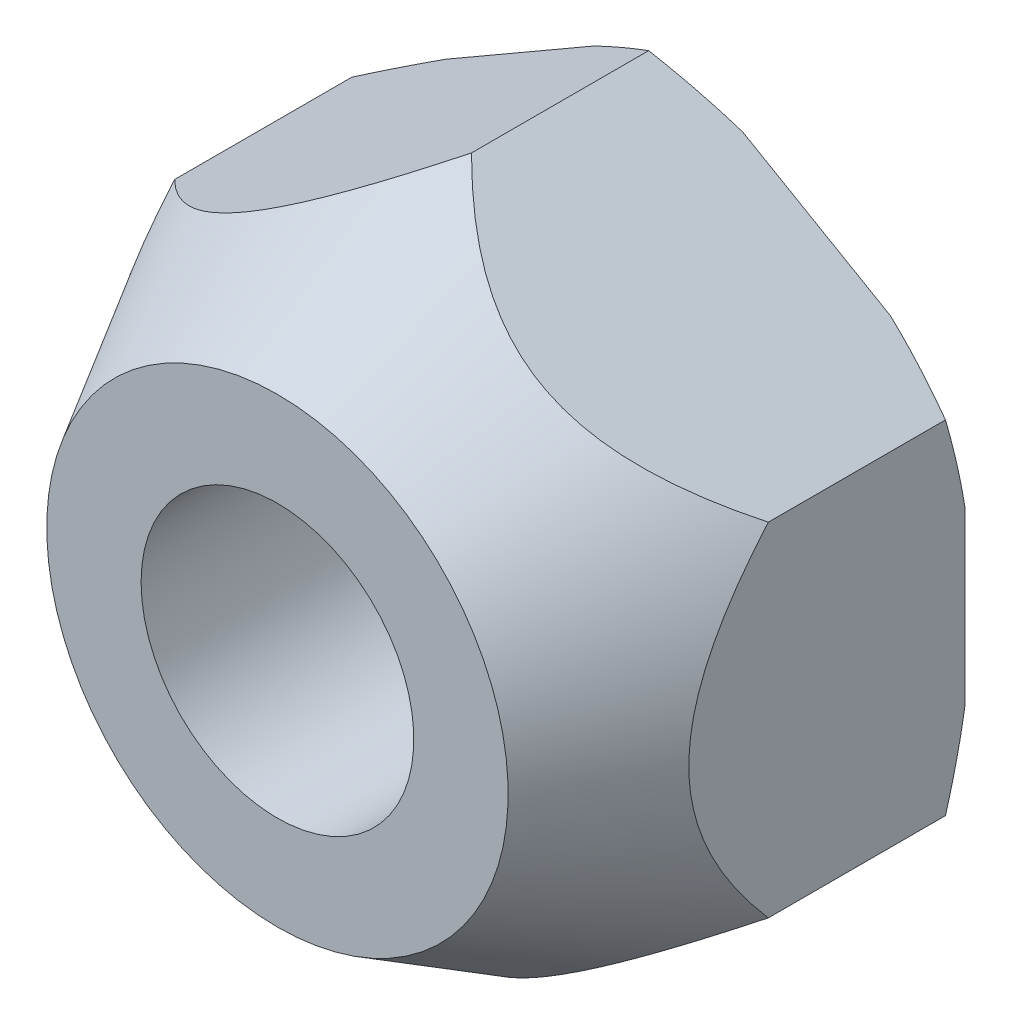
ISO-10303-21;
HEADER;
FILE_DESCRIPTION(('STEP AP214'),'2;1');
FILE_NAME('part.step','',(''),(''),'','','');
FILE_SCHEMA(('AUTOMOTIVE_DESIGN { 1 0 10303 214 1 1 1 1 }'));
ENDSEC;
DATA;
#1=APPLICATION_CONTEXT('core data for automotive mechanical design processes');
#2=APPLICATION_PROTOCOL_DEFINITION('international standard','automotive_design',2000,#1);
#3=PRODUCT_CONTEXT('',#1,'mechanical');
#4=PRODUCT('Part','Part','',(#3));
#5=PRODUCT_RELATED_PRODUCT_CATEGORY('part','',(#4));
#6=PRODUCT_DEFINITION_FORMATION('','',#4);
#7=PRODUCT_DEFINITION_CONTEXT('part definition',#1,'design');
#8=PRODUCT_DEFINITION('design','',#6,#7);
#9=PRODUCT_DEFINITION_SHAPE('','',#8);
#10=(LENGTH_UNIT() NAMED_UNIT(*) SI_UNIT(.MILLI.,.METRE.));
#11=(NAMED_UNIT(*) PLANE_ANGLE_UNIT() SI_UNIT($,.RADIAN.));
#12=(NAMED_UNIT(*) SI_UNIT($,.STERADIAN.) SOLID_ANGLE_UNIT());
#13=UNCERTAINTY_MEASURE_WITH_UNIT(LENGTH_MEASURE(1.E-05),#10,'distance_accuracy_value','');
#14=(GEOMETRIC_REPRESENTATION_CONTEXT(3) GLOBAL_UNCERTAINTY_ASSIGNED_CONTEXT((#13)) GLOBAL_UNIT_ASSIGNED_CONTEXT((#10,
#11,#12)) REPRESENTATION_CONTEXT('',''));
#15=CARTESIAN_POINT('',(0.,0.,0.));
#16=DIRECTION('',(0.,0.,1.));
#17=DIRECTION('',(1.,0.,0.));
#18=AXIS2_PLACEMENT_3D('',#15,#16,#17);
#19=CARTESIAN_POINT('',(0.,0.,0.));
#20=DIRECTION('',(0.,0.,1.));
#21=DIRECTION('',(1.,0.,0.));
#22=AXIS2_PLACEMENT_3D('',#19,#20,#21);
#23=PLANE('',#22);
#24=CARTESIAN_POINT('',(0.,0.,0.));
#25=DIRECTION('',(0.,0.,-1.));
#26=DIRECTION('',(0.,1.,0.));
#27=AXIS2_PLACEMENT_3D('',#24,#25,#26);
#28=CIRCLE('',#27,3.175);
#29=CARTESIAN_POINT('',(0.,3.175,0.));
#30=VERTEX_POINT('',#29);
#31=EDGE_CURVE('E316',#30,#30,#28,.T.);
#32=ORIENTED_EDGE('',*,*,#31,.F.);
#33=EDGE_LOOP('',(#32));
#34=FACE_BOUND('',#33,.T.);
#35=CARTESIAN_POINT('',(0.,0.,0.));
#36=DIRECTION('',(0.,0.,-1.));
#37=DIRECTION('',(0.,1.,0.));
#38=AXIS2_PLACEMENT_3D('',#35,#36,#37);
#39=CIRCLE('',#38,5.78080486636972);
#40=CARTESIAN_POINT('',(4.15991482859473,4.01407692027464,0.));
#41=VERTEX_POINT('',#40);
#42=CARTESIAN_POINT('',(5.55625,1.59555345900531,0.));
#43=VERTEX_POINT('',#42);
#44=EDGE_CURVE('E72',#41,#43,#39,.T.);
#45=ORIENTED_EDGE('',*,*,#44,.T.);
#46=DIRECTION('',(0.,1.,0.));
#47=VECTOR('',#46,1.);
#48=CARTESIAN_POINT('',(5.55625,-3.20790243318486,0.));
#49=LINE('',#48,#47);
#50=CARTESIAN_POINT('',(5.55625,-1.59555345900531,0.));
#51=VERTEX_POINT('',#50);
#52=EDGE_CURVE('E362',#51,#43,#49,.T.);
#53=ORIENTED_EDGE('',*,*,#52,.F.);
#54=CARTESIAN_POINT('',(4.15991482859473,-4.01407692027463,0.));
#55=VERTEX_POINT('',#54);
#56=EDGE_CURVE('E64',#51,#55,#39,.T.);
#57=ORIENTED_EDGE('',*,*,#56,.T.);
#58=DIRECTION('',(0.866025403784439,0.5,0.));
#59=VECTOR('',#58,1.);
#60=CARTESIAN_POINT('',(0.,-6.41580486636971,0.));
#61=LINE('',#60,#59);
#62=CARTESIAN_POINT('',(1.39633517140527,-5.60963037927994,0.));
#63=VERTEX_POINT('',#62);
#64=EDGE_CURVE('E182',#63,#55,#61,.T.);
#65=ORIENTED_EDGE('',*,*,#64,.F.);
#66=CARTESIAN_POINT('',(-1.39633517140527,-5.60963037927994,0.));
#67=VERTEX_POINT('',#66);
#68=EDGE_CURVE('E313',#63,#67,#39,.T.);
#69=ORIENTED_EDGE('',*,*,#68,.T.);
#70=DIRECTION('',(0.866025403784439,-0.5,0.));
#71=VECTOR('',#70,1.);
#72=CARTESIAN_POINT('',(-5.55625,-3.20790243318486,0.));
#73=LINE('',#72,#71);
#74=CARTESIAN_POINT('',(-4.15991482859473,-4.01407692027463,0.));
#75=VERTEX_POINT('',#74);
#76=EDGE_CURVE('E178',#75,#67,#73,.T.);
#77=ORIENTED_EDGE('',*,*,#76,.F.);
#78=CARTESIAN_POINT('',(-5.55625,-1.5955534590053,0.));
#79=VERTEX_POINT('',#78);
#80=EDGE_CURVE('E312',#75,#79,#39,.T.);
#81=ORIENTED_EDGE('',*,*,#80,.T.);
#82=DIRECTION('',(0.,-1.,0.));
#83=VECTOR('',#82,1.);
#84=CARTESIAN_POINT('',(-5.55625,3.20790243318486,0.));
#85=LINE('',#84,#83);
#86=CARTESIAN_POINT('',(-5.55625,1.5955534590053,0.));
#87=VERTEX_POINT('',#86);
#88=EDGE_CURVE('E174',#87,#79,#85,.T.);
#89=ORIENTED_EDGE('',*,*,#88,.F.);
#90=CARTESIAN_POINT('',(-4.15991482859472,4.01407692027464,0.));
#91=VERTEX_POINT('',#90);
#92=EDGE_CURVE('E307',#87,#91,#39,.T.);
#93=ORIENTED_EDGE('',*,*,#92,.T.);
#94=DIRECTION('',(-0.866025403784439,-0.5,0.));
#95=VECTOR('',#94,1.);
#96=CARTESIAN_POINT('',(0.,6.41580486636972,0.));
#97=LINE('',#96,#95);
#98=CARTESIAN_POINT('',(-1.39633517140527,5.60963037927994,0.));
#99=VERTEX_POINT('',#98);
#100=EDGE_CURVE('E163',#99,#91,#97,.T.);
#101=ORIENTED_EDGE('',*,*,#100,.F.);
#102=CARTESIAN_POINT('',(1.39633517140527,5.60963037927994,0.));
#103=VERTEX_POINT('',#102);
#104=EDGE_CURVE('E141',#99,#103,#39,.T.);
#105=ORIENTED_EDGE('',*,*,#104,.T.);
#106=DIRECTION('',(-0.866025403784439,0.5,0.));
#107=VECTOR('',#106,1.);
#108=CARTESIAN_POINT('',(5.55625,3.20790243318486,0.));
#109=LINE('',#108,#107);
#110=EDGE_CURVE('E155',#41,#103,#109,.T.);
#111=ORIENTED_EDGE('',*,*,#110,.F.);
#112=EDGE_LOOP('',(#45,#53,#57,#65,#69,#77,#81,#89,#93,#101,#105,#111));
#113=FACE_BOUND('',#112,.T.);
#114=ADVANCED_FACE('F43',(#34,#113),#23,.F.);
#115=CARTESIAN_POINT('',(0.,-6.41580486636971,24.2898241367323));
#116=DIRECTION('',(-0.5,0.866025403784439,0.));
#117=DIRECTION('',(-0.866025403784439,-0.5,0.));
#118=AXIS2_PLACEMENT_3D('',#115,#116,#117);
#119=PLANE('',#118);
#120=CARTESIAN_POINT('',(9.4122126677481,-0.981661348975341,2.12607001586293));
#121=CARTESIAN_POINT('',(9.23765260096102,-1.08244365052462,2.03188771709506));
#122=CARTESIAN_POINT('',(9.0626746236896,-1.18346723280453,1.93872232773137));
#123=CARTESIAN_POINT('',(8.71170662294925,-1.38609870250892,1.75490294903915));
#124=CARTESIAN_POINT('',(8.53571647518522,-1.48770666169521,1.66424927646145));
#125=CARTESIAN_POINT('',(8.18202436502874,-1.6919108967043,1.4856683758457));
#126=CARTESIAN_POINT('',(8.00431871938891,-1.79450929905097,1.39775084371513));
#127=CARTESIAN_POINT('',(7.64757550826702,-2.00047508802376,1.22560393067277));
#128=CARTESIAN_POINT('',(7.46853798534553,-2.10384245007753,1.14137443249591));
#129=CARTESIAN_POINT('',(7.10435293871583,-2.31410478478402,0.975329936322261));
#130=CARTESIAN_POINT('',(6.9191656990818,-2.42102268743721,0.893630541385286));
#131=CARTESIAN_POINT('',(6.54692272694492,-2.63593726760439,0.736056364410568));
#132=CARTESIAN_POINT('',(6.3598669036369,-2.74393399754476,0.660181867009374));
#133=CARTESIAN_POINT('',(5.98384361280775,-2.96103114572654,0.515702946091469));
#134=CARTESIAN_POINT('',(5.79487818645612,-3.07013038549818,0.447091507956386));
#135=CARTESIAN_POINT('',(5.41472876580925,-3.28960975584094,0.318723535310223));
#136=CARTESIAN_POINT('',(5.22354506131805,-3.3999897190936,0.258965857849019));
#137=CARTESIAN_POINT('',(4.76629901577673,-3.66398084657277,0.129716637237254));
#138=CARTESIAN_POINT('',(4.49917118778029,-3.81820716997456,0.0650441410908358));
#139=CARTESIAN_POINT('',(4.09574226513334,-4.05112696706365,-0.0126633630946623));
#140=CARTESIAN_POINT('',(3.96081204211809,-4.12902896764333,-0.0353487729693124));
#141=CARTESIAN_POINT('',(3.69021270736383,-4.28525956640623,-0.0737151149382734));
#142=CARTESIAN_POINT('',(3.55454369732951,-4.36358810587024,-0.0893969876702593));
#143=CARTESIAN_POINT('',(3.28427954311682,-4.51962518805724,-0.113170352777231));
#144=CARTESIAN_POINT('',(3.1496900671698,-4.59733045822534,-0.121347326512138));
#145=CARTESIAN_POINT('',(2.88032546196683,-4.75284818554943,-0.130176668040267));
#146=CARTESIAN_POINT('',(2.74555033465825,-4.83066064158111,-0.130829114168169));
#147=CARTESIAN_POINT('',(2.47613235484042,-4.98620918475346,-0.124588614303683));
#148=CARTESIAN_POINT('',(2.34148950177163,-5.06394527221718,-0.117695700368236));
#149=CARTESIAN_POINT('',(2.07262237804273,-5.2191757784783,-0.0965730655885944));
#150=CARTESIAN_POINT('',(1.93839817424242,-5.29667015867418,-0.0823422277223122));
#151=CARTESIAN_POINT('',(1.6212548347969,-5.47977295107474,-0.0404093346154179));
#152=CARTESIAN_POINT('',(1.43863413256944,-5.58520906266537,-0.0096746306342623));
#153=CARTESIAN_POINT('',(1.07514176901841,-5.79507147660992,0.0633663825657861));
#154=CARTESIAN_POINT('',(0.894270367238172,-5.89949762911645,0.105674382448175));
#155=CARTESIAN_POINT('',(0.534298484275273,-6.10732749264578,0.2002647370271));
#156=CARTESIAN_POINT('',(0.355200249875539,-6.21072990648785,0.252558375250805));
#157=CARTESIAN_POINT('',(-0.000985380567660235,-6.41637377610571,0.365472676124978));
#158=CARTESIAN_POINT('',(-0.178072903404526,-6.5186153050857,0.426092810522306));
#159=CARTESIAN_POINT('',(-0.532455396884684,-6.72321813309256,0.554982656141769));
#160=CARTESIAN_POINT('',(-0.709727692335,-6.82556634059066,0.623334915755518));
#161=CARTESIAN_POINT('',(-1.06239428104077,-7.02917849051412,0.765774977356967));
#162=CARTESIAN_POINT('',(-1.23778973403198,-7.13044310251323,0.839858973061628));
#163=CARTESIAN_POINT('',(-1.58698222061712,-7.33204947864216,0.992745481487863));
#164=CARTESIAN_POINT('',(-1.76077958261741,-7.43239143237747,1.07154699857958));
#165=CARTESIAN_POINT('',(-2.10701193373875,-7.63228877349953,1.23304271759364));
#166=CARTESIAN_POINT('',(-2.27944689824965,-7.73184414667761,1.31573698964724));
#167=CARTESIAN_POINT('',(-2.56995609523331,-7.89956970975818,1.45825735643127));
#168=CARTESIAN_POINT('',(-2.68834126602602,-7.96791941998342,1.51724194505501));
#169=CARTESIAN_POINT('',(-2.92459527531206,-8.10432073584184,1.63656184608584));
#170=CARTESIAN_POINT('',(-3.04246413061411,-8.17237235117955,1.69689711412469));
#171=CARTESIAN_POINT('',(-3.2765031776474,-8.3074948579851,1.81812003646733));
#172=CARTESIAN_POINT('',(-3.39267821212,-8.37456854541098,1.87899524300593));
#173=CARTESIAN_POINT('',(-3.62461811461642,-8.5084791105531,2.00178528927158));
#174=CARTESIAN_POINT('',(-3.74038297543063,-8.57531598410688,2.0637001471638));
#175=CARTESIAN_POINT('',(-3.85596266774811,-8.64204595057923,2.12607001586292));
#176=B_SPLINE_CURVE_WITH_KNOTS('',3,(#120,#121,#122,#123,#124,#125,#126,#127,#128,#129,#130,
#131,#132,#133,#134,#135,#136,#137,#138,#139,#140,#141,#142,#143,#144,#145,#146,#147,#148,#149,
#150,#151,#152,#153,#154,#155,#156,#157,#158,#159,#160,#161,#162,#163,#164,#165,#166,#167,#168,
#169,#170,#171,#172,#173,#174,#175),.UNSPECIFIED.,.F.,.F.,(4,2,2,2,2,2,2,2,2,2,2,2,2,2,2,2,2,2,
2,2,2,2,2,2,2,2,2,4),(0.,0.667455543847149,1.33499488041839,2.00467901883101,2.67434184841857,
3.36100743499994,4.04770655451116,4.73373629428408,5.41967739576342,6.36412924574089,
6.83633936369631,7.3084860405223,7.77518566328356,8.24188042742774,8.70857320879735,
9.1753370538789,9.8142510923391,10.4532585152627,11.092992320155,11.732685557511,
12.3800017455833,13.0268916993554,13.6736456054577,14.3204111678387,14.7670507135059,
15.2136756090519,15.6556119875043,16.0975560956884),.UNSPECIFIED.);
#177=CARTESIAN_POINT('',(5.55625,-3.20790243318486,0.366617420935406));
#178=VERTEX_POINT('',#177);
#179=EDGE_CURVE('E267',#178,#55,#176,.T.);
#180=ORIENTED_EDGE('',*,*,#179,.F.);
#181=DIRECTION('',(0.,0.,-1.));
#182=VECTOR('',#181,1.);
#183=CARTESIAN_POINT('',(5.55625,-3.20790243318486,24.2898241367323));
#184=LINE('',#183,#182);
#185=CARTESIAN_POINT('',(5.55625,-3.20790243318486,3.683));
#186=VERTEX_POINT('',#185);
#187=EDGE_CURVE('E356',#186,#178,#184,.T.);
#188=ORIENTED_EDGE('',*,*,#187,.F.);
#189=CARTESIAN_POINT('',(5.55645,-3.20778696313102,3.68279999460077));
#190=CARTESIAN_POINT('',(5.49833609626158,-3.24133904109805,3.74091108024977));
#191=CARTESIAN_POINT('',(5.43964232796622,-3.27522590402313,3.79824712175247));
#192=CARTESIAN_POINT('',(5.32096742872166,-3.34374288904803,3.91115305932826));
#193=CARTESIAN_POINT('',(5.26098593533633,-3.37837322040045,3.96672244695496));
#194=CARTESIAN_POINT('',(5.07835054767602,-3.48381781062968,4.1309628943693));
#195=CARTESIAN_POINT('',(4.95359547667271,-3.55584518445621,4.23656936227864));
#196=CARTESIAN_POINT('',(4.69437356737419,-3.70550702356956,4.43956538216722));
#197=CARTESIAN_POINT('',(4.55973908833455,-3.7832382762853,4.53667214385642));
#198=CARTESIAN_POINT('',(4.28317668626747,-3.94291165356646,4.71540813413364));
#199=CARTESIAN_POINT('',(4.14126579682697,-4.02484394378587,4.79707158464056));
#200=CARTESIAN_POINT('',(3.91634650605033,-4.15470115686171,4.9074096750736));
#201=CARTESIAN_POINT('',(3.83597102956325,-4.20110595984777,4.94327129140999));
#202=CARTESIAN_POINT('',(3.67311495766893,-4.29513095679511,5.00804331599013));
#203=CARTESIAN_POINT('',(3.59063420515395,-4.34275124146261,5.03695320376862));
#204=CARTESIAN_POINT('',(3.42455185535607,-4.43863893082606,5.08671661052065));
#205=CARTESIAN_POINT('',(3.3409643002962,-4.48689822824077,5.1076320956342));
#206=CARTESIAN_POINT('',(3.17253119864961,-4.58414312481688,5.14097289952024));
#207=CARTESIAN_POINT('',(3.08768589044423,-4.63312858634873,5.15339980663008));
#208=CARTESIAN_POINT('',(2.9165745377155,-4.73191977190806,5.16934080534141));
#209=CARTESIAN_POINT('',(2.83030260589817,-4.7817288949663,5.17277170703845));
#210=CARTESIAN_POINT('',(2.65785942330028,-4.88128901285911,5.17033197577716));
#211=CARTESIAN_POINT('',(2.57168817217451,-4.93104000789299,5.16446137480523));
#212=CARTESIAN_POINT('',(2.39998973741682,-5.03017014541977,5.14364810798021));
#213=CARTESIAN_POINT('',(2.31446436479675,-5.07954824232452,5.12868571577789));
#214=CARTESIAN_POINT('',(2.14482336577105,-5.1774905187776,5.0902655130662));
#215=CARTESIAN_POINT('',(2.06070862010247,-5.22605418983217,5.06680258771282));
#216=CARTESIAN_POINT('',(1.87037522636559,-5.33594322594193,5.00432563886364));
#217=CARTESIAN_POINT('',(1.76478066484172,-5.3969082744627,4.96277799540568));
#218=CARTESIAN_POINT('',(1.55723178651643,-5.51673667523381,4.86891436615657));
#219=CARTESIAN_POINT('',(1.45527976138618,-5.57559870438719,4.81659173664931));
#220=CARTESIAN_POINT('',(1.25476788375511,-5.69136429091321,4.70287520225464));
#221=CARTESIAN_POINT('',(1.15622338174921,-5.74825898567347,4.64144554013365));
#222=CARTESIAN_POINT('',(0.962841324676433,-5.85990816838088,4.51135640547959));
#223=CARTESIAN_POINT('',(0.86800316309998,-5.91466300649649,4.44269812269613));
#224=CARTESIAN_POINT('',(0.638340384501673,-6.04725887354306,4.26616958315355));
#225=CARTESIAN_POINT('',(0.505460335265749,-6.12397720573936,4.15492770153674));
#226=CARTESIAN_POINT('',(0.311627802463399,-6.2358864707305,3.98175566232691));
#227=CARTESIAN_POINT('',(0.248274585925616,-6.27246346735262,3.92332791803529));
#228=CARTESIAN_POINT('',(0.123000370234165,-6.3447905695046,3.80448764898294));
#229=CARTESIAN_POINT('',(0.061079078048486,-6.38054084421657,3.7440755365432));
#230=CARTESIAN_POINT('',(-0.000199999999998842,-6.41592033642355,3.68279999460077));
#231=B_SPLINE_CURVE_WITH_KNOTS('',3,(#189,#190,#191,#192,#193,#194,#195,#196,#197,#198,#199,
#200,#201,#202,#203,#204,#205,#206,#207,#208,#209,#210,#211,#212,#213,#214,#215,#216,#217,#218,
#219,#220,#221,#222,#223,#224,#225,#226,#227,#228,#229,#230),.UNSPECIFIED.,.F.,.F.,(4,2,2,2,2,2,
2,2,2,2,2,2,2,2,2,2,2,2,2,2,4),(0.,0.266293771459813,0.532663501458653,1.06811595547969,
1.61740258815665,2.1654573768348,2.46372298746,2.76201092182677,3.05793747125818,
3.35380863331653,3.65240634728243,3.95100303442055,4.25024990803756,4.54967714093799,
4.93548916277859,5.32153978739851,5.70914841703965,6.09669335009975,6.66470266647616,
6.94554888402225,7.22633711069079),.UNSPECIFIED.);
#232=CARTESIAN_POINT('',(0.,-6.41580486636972,3.683));
#233=VERTEX_POINT('',#232);
#234=EDGE_CURVE('E183',#186,#233,#231,.T.);
#235=ORIENTED_EDGE('',*,*,#234,.T.);
#236=DIRECTION('',(0.,0.,-1.));
#237=VECTOR('',#236,1.);
#238=CARTESIAN_POINT('',(0.,-6.41580486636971,24.2898241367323));
#239=LINE('',#238,#237);
#240=CARTESIAN_POINT('',(0.,-6.41580486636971,0.366617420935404));
#241=VERTEX_POINT('',#240);
#242=EDGE_CURVE('E179',#233,#241,#239,.T.);
#243=ORIENTED_EDGE('',*,*,#242,.T.);
#244=EDGE_CURVE('E271',#63,#241,#176,.T.);
#245=ORIENTED_EDGE('',*,*,#244,.F.);
#246=ORIENTED_EDGE('',*,*,#64,.T.);
#247=EDGE_LOOP('',(#180,#188,#235,#243,#245,#246));
#248=FACE_BOUND('',#247,.T.);
#249=ADVANCED_FACE('F248',(#248),#119,.F.);
#250=CARTESIAN_POINT('',(5.55625,-3.20790243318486,24.2898241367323));
#251=DIRECTION('',(-1.,0.,0.));
#252=DIRECTION('',(0.,0.,1.));
#253=AXIS2_PLACEMENT_3D('',#250,#251,#252);
#254=PLANE('',#253);
#255=CARTESIAN_POINT('',(5.55625,7.06386510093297,1.85122402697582));
#256=CARTESIAN_POINT('',(5.55625,6.86314115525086,1.76016151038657));
#257=CARTESIAN_POINT('',(5.55625,6.66186791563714,1.67028668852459));
#258=CARTESIAN_POINT('',(5.55625,6.25798755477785,1.49348876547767));
#259=CARTESIAN_POINT('',(5.55625,6.05538019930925,1.4065662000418));
#260=CARTESIAN_POINT('',(5.55625,5.64781846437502,1.23592647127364));
#261=CARTESIAN_POINT('',(5.55625,5.44285781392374,1.1522242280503));
#262=CARTESIAN_POINT('',(5.55625,5.03120326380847,0.989207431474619));
#263=CARTESIAN_POINT('',(5.55625,4.82450944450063,0.909892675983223));
#264=CARTESIAN_POINT('',(5.55625,4.41006730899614,0.7569723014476));
#265=CARTESIAN_POINT('',(5.55625,4.20232792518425,0.68334259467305));
#266=CARTESIAN_POINT('',(5.55625,3.78462820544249,0.542595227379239));
#267=CARTESIAN_POINT('',(5.55625,3.57466776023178,0.475477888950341));
#268=CARTESIAN_POINT('',(5.55625,3.15263624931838,0.349296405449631));
#269=CARTESIAN_POINT('',(5.55625,2.94056846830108,0.290221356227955));
#270=CARTESIAN_POINT('',(5.55625,2.5139588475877,0.181696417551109));
#271=CARTESIAN_POINT('',(5.55625,2.2994171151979,0.132246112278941));
#272=CARTESIAN_POINT('',(5.55625,1.92902684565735,0.0571565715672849));
#273=CARTESIAN_POINT('',(5.55625,1.77374138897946,0.0287386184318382));
#274=CARTESIAN_POINT('',(5.55625,1.46213096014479,-0.0215589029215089));
#275=CARTESIAN_POINT('',(5.55625,1.30580616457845,-0.0434395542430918));
#276=CARTESIAN_POINT('',(5.55625,0.992347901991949,-0.0800899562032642));
#277=CARTESIAN_POINT('',(5.55625,0.835214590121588,-0.0948610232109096));
#278=CARTESIAN_POINT('',(5.55625,0.520416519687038,-0.11686910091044));
#279=CARTESIAN_POINT('',(5.55625,0.362751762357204,-0.124106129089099));
#280=CARTESIAN_POINT('',(5.55625,0.0473353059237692,-0.130820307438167));
#281=CARTESIAN_POINT('',(5.55625,-0.110416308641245,-0.130301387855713));
#282=CARTESIAN_POINT('',(5.55625,-0.425700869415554,-0.121530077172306));
#283=CARTESIAN_POINT('',(5.55625,-0.58323381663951,-0.113277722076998));
#284=CARTESIAN_POINT('',(5.55625,-0.897731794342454,-0.089291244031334));
#285=CARTESIAN_POINT('',(5.55625,-1.0546968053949,-0.0735568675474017));
#286=CARTESIAN_POINT('',(5.55625,-1.36777406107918,-0.0350605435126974));
#287=CARTESIAN_POINT('',(5.55625,-1.52388614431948,-0.0122973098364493));
#288=CARTESIAN_POINT('',(5.55625,-2.14554894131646,0.091563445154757));
#289=CARTESIAN_POINT('',(5.55625,-2.60691847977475,0.198420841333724));
#290=CARTESIAN_POINT('',(5.55625,-3.2904566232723,0.388883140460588));
#291=CARTESIAN_POINT('',(5.55625,-3.51717853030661,0.45751115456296));
#292=CARTESIAN_POINT('',(5.55625,-3.9680102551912,0.602929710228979));
#293=CARTESIAN_POINT('',(5.55625,-4.19212025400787,0.679719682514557));
#294=CARTESIAN_POINT('',(5.55625,-4.64049480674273,0.840764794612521));
#295=CARTESIAN_POINT('',(5.55625,-4.86473203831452,0.925095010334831));
#296=CARTESIAN_POINT('',(5.55625,-5.31111512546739,1.09914597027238));
#297=CARTESIAN_POINT('',(5.55625,-5.5332608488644,1.18886705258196));
#298=CARTESIAN_POINT('',(5.55625,-5.97437282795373,1.37207417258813));
#299=CARTESIAN_POINT('',(5.55625,-6.1933502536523,1.46553345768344));
#300=CARTESIAN_POINT('',(5.55625,-6.62971931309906,1.65594516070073));
#301=CARTESIAN_POINT('',(5.55625,-6.84711132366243,1.75289671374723));
#302=CARTESIAN_POINT('',(5.55625,-7.06386510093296,1.85122402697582));
#303=B_SPLINE_CURVE_WITH_KNOTS('',3,(#255,#256,#257,#258,#259,#260,#261,#262,#263,#264,#265,
#266,#267,#268,#269,#270,#271,#272,#273,#274,#275,#276,#277,#278,#279,#280,#281,#282,#283,#284,
#285,#286,#287,#288,#289,#290,#291,#292,#293,#294,#295,#296,#297,#298,#299,#300,#301,#302),
.UNSPECIFIED.,.F.,.F.,(4,2,2,2,2,2,2,2,2,2,2,2,2,2,2,2,2,2,2,2,2,2,2,4),(0.,0.661253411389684,
1.32262618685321,1.98676396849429,2.65087112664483,3.31198943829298,3.97314043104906,
4.63338587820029,5.29360279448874,5.76707495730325,6.24046863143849,6.7137746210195,
7.18707951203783,7.66014456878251,8.13320742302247,8.60628630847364,9.07945180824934,
10.4968560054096,11.2074467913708,11.9179880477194,12.6366235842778,13.3553042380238,
14.0695348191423,14.7835897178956),.UNSPECIFIED.);
#304=CARTESIAN_POINT('',(5.55625,3.20790243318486,0.366617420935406));
#305=VERTEX_POINT('',#304);
#306=EDGE_CURVE('E255',#305,#43,#303,.T.);
#307=ORIENTED_EDGE('',*,*,#306,.F.);
#308=DIRECTION('',(0.,0.,-1.));
#309=VECTOR('',#308,1.);
#310=CARTESIAN_POINT('',(5.55625,3.20790243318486,24.2898241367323));
#311=LINE('',#310,#309);
#312=CARTESIAN_POINT('',(5.55625,3.20790243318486,3.683));
#313=VERTEX_POINT('',#312);
#314=EDGE_CURVE('E167',#313,#305,#311,.T.);
#315=ORIENTED_EDGE('',*,*,#314,.F.);
#316=CARTESIAN_POINT('',(5.55625,-13.5963760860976,-10.6446271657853));
#317=CARTESIAN_POINT('',(5.55625,-13.2856335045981,-10.1464663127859));
#318=CARTESIAN_POINT('',(5.55625,-12.973847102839,-9.64895203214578));
#319=CARTESIAN_POINT('',(5.55625,-12.3475490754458,-8.65558305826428));
#320=CARTESIAN_POINT('',(5.55625,-12.033037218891,-8.15972851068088));
#321=CARTESIAN_POINT('',(5.55625,-11.3994529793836,-7.16817351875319));
#322=CARTESIAN_POINT('',(5.55625,-11.0803674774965,-6.67248144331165));
#323=CARTESIAN_POINT('',(5.55625,-10.4379800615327,-5.68387617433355));
#324=CARTESIAN_POINT('',(5.55625,-10.1146783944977,-5.1909628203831));
#325=CARTESIAN_POINT('',(5.55625,-9.4302266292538,-4.15994315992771));
#326=CARTESIAN_POINT('',(5.55625,-9.06850770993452,-3.62221278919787));
#327=CARTESIAN_POINT('',(5.55625,-8.51911708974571,-2.82020136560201));
#328=CARTESIAN_POINT('',(5.55625,-8.3348318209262,-2.55360052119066));
#329=CARTESIAN_POINT('',(5.55625,-7.96356398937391,-2.02228529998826));
#330=CARTESIAN_POINT('',(5.55625,-7.7765814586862,-1.75757090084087));
#331=CARTESIAN_POINT('',(5.55625,-7.39976352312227,-1.23098265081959));
#332=CARTESIAN_POINT('',(5.55625,-7.20993462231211,-0.96910415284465));
#333=CARTESIAN_POINT('',(5.55625,-6.82637162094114,-0.448227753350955));
#334=CARTESIAN_POINT('',(5.55625,-6.63263763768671,-0.189229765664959));
#335=CARTESIAN_POINT('',(5.55625,-6.24041682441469,0.325016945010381));
#336=CARTESIAN_POINT('',(5.55625,-6.04193155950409,0.580266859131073));
#337=CARTESIAN_POINT('',(5.55625,-5.63895651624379,1.08596980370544));
#338=CARTESIAN_POINT('',(5.55625,-5.4344673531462,1.33642332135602));
#339=CARTESIAN_POINT('',(5.55625,-5.11562287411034,1.71478112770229));
#340=CARTESIAN_POINT('',(5.55625,-5.0040276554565,1.84501215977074));
#341=CARTESIAN_POINT('',(5.55625,-4.7783411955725,2.10330487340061));
#342=CARTESIAN_POINT('',(5.55625,-4.66424988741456,2.23136649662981));
#343=CARTESIAN_POINT('',(5.55625,-4.43305954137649,2.48502626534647));
#344=CARTESIAN_POINT('',(5.55625,-4.31595713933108,2.61062135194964));
#345=CARTESIAN_POINT('',(5.55625,-4.07841438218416,2.85861692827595));
#346=CARTESIAN_POINT('',(5.55625,-3.9579741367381,2.98101752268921));
#347=CARTESIAN_POINT('',(5.55625,-3.71466892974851,3.22042670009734));
#348=CARTESIAN_POINT('',(5.55625,-3.59185051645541,3.33748241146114));
#349=CARTESIAN_POINT('',(5.55625,-3.34178708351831,3.56676022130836));
#350=CARTESIAN_POINT('',(5.55625,-3.21454262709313,3.67898293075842));
#351=CARTESIAN_POINT('',(5.55625,-2.95509209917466,3.89710969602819));
#352=CARTESIAN_POINT('',(5.55625,-2.8228949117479,4.00302425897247));
#353=CARTESIAN_POINT('',(5.55625,-2.55255271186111,4.20692618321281));
#354=CARTESIAN_POINT('',(5.55625,-2.41441055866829,4.304917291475));
#355=CARTESIAN_POINT('',(5.55625,-2.1684079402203,4.46623454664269));
#356=CARTESIAN_POINT('',(5.55625,-2.06209689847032,4.53191617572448));
#357=CARTESIAN_POINT('',(5.55625,-1.84546001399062,4.6563886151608));
#358=CARTESIAN_POINT('',(5.55625,-1.73513365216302,4.71517853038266));
#359=CARTESIAN_POINT('',(5.55625,-1.5106482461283,4.82418141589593));
#360=CARTESIAN_POINT('',(5.55625,-1.39650014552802,4.87441672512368));
#361=CARTESIAN_POINT('',(5.55625,-1.16426768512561,4.96473363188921));
#362=CARTESIAN_POINT('',(5.55625,-1.04618562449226,5.0048210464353));
#363=CARTESIAN_POINT('',(5.55625,-0.83600595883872,5.06469353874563));
#364=CARTESIAN_POINT('',(5.55625,-0.744639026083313,5.08704662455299));
#365=CARTESIAN_POINT('',(5.55625,-0.56042490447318,5.12425925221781));
#366=CARTESIAN_POINT('',(5.55625,-0.467578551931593,5.13912288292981));
#367=CARTESIAN_POINT('',(5.55625,-0.280966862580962,5.16084475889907));
#368=CARTESIAN_POINT('',(5.55625,-0.187201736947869,5.16770480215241));
#369=CARTESIAN_POINT('',(5.55625,0.000572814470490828,5.17316637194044));
#370=CARTESIAN_POINT('',(5.55625,0.094582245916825,5.17176770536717));
#371=CARTESIAN_POINT('',(5.55625,0.282045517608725,5.16076625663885));
#372=CARTESIAN_POINT('',(5.55625,0.3754997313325,5.15116982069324));
#373=CARTESIAN_POINT('',(5.55625,0.561282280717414,5.12414612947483));
#374=CARTESIAN_POINT('',(5.55625,0.65361013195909,5.1067156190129));
#375=CARTESIAN_POINT('',(5.55625,0.92805632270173,5.04351223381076));
#376=CARTESIAN_POINT('',(5.55625,1.10772659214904,4.98682137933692));
#377=CARTESIAN_POINT('',(5.55625,1.42444273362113,4.86346830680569));
#378=CARTESIAN_POINT('',(5.55625,1.56309959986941,4.80074908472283));
#379=CARTESIAN_POINT('',(5.55625,1.83443035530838,4.6633386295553));
#380=CARTESIAN_POINT('',(5.55625,1.96709991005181,4.58863889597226));
#381=CARTESIAN_POINT('',(5.55625,2.22815233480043,4.42899517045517));
#382=CARTESIAN_POINT('',(5.55625,2.35646866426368,4.34394359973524));
#383=CARTESIAN_POINT('',(5.55625,2.54491882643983,4.21080609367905));
#384=CARTESIAN_POINT('',(5.55625,2.60705303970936,4.16550965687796));
#385=CARTESIAN_POINT('',(5.55625,2.73007600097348,4.07325842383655));
#386=CARTESIAN_POINT('',(5.55625,2.7909647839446,4.02630367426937));
#387=CARTESIAN_POINT('',(5.55625,2.98641674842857,3.87174805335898));
#388=CARTESIAN_POINT('',(5.55625,3.11864828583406,3.76119074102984));
#389=CARTESIAN_POINT('',(5.55625,3.37812973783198,3.53435360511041));
#390=CARTESIAN_POINT('',(5.55625,3.50537812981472,3.41807205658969));
#391=CARTESIAN_POINT('',(5.55625,3.75572628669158,3.18088843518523));
#392=CARTESIAN_POINT('',(5.55625,3.87882166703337,3.05998174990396));
#393=CARTESIAN_POINT('',(5.55625,4.12135115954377,2.81454160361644));
#394=CARTESIAN_POINT('',(5.55625,4.24078488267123,2.69000775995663));
#395=CARTESIAN_POINT('',(5.55625,4.59564050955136,2.31068151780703));
#396=CARTESIAN_POINT('',(5.55625,4.82630177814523,2.05143695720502));
#397=CARTESIAN_POINT('',(5.55625,5.27818846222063,1.52485301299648));
#398=CARTESIAN_POINT('',(5.55625,5.49941207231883,1.25751209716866));
#399=CARTESIAN_POINT('',(5.55625,5.8144032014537,0.866254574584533));
#400=CARTESIAN_POINT('',(5.55625,5.91108594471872,0.744670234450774));
#401=CARTESIAN_POINT('',(5.55625,6.10312971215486,0.500481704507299));
#402=CARTESIAN_POINT('',(5.55625,6.19849086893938,0.377877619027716));
#403=CARTESIAN_POINT('',(5.55625,6.48285323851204,0.00866106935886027));
#404=CARTESIAN_POINT('',(5.55625,6.67009473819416,-0.239307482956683));
#405=CARTESIAN_POINT('',(5.55625,7.03844445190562,-0.734952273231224));
#406=CARTESIAN_POINT('',(5.55625,7.21960007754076,-0.982593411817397));
#407=CARTESIAN_POINT('',(5.55625,7.57874866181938,-1.48005450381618));
#408=CARTESIAN_POINT('',(5.55625,7.75674249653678,-1.729873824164));
#409=CARTESIAN_POINT('',(5.55625,7.93348561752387,-1.98056402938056));
#410=B_SPLINE_CURVE_WITH_KNOTS('',3,(#316,#317,#318,#319,#320,#321,#322,#323,#324,#325,#326,
#327,#328,#329,#330,#331,#332,#333,#334,#335,#336,#337,#338,#339,#340,#341,#342,#343,#344,#345,
#346,#347,#348,#349,#350,#351,#352,#353,#354,#355,#356,#357,#358,#359,#360,#361,#362,#363,#364,
#365,#366,#367,#368,#369,#370,#371,#372,#373,#374,#375,#376,#377,#378,#379,#380,#381,#382,#383,
#384,#385,#386,#387,#388,#389,#390,#391,#392,#393,#394,#395,#396,#397,#398,#399,#400,#401,#402,
#403,#404,#405,#406,#407,#408,#409),.UNSPECIFIED.,.F.,.F.,(4,2,2,2,2,2,2,2,2,2,2,2,2,2,2,2,2,2,
2,2,2,2,2,2,2,2,2,2,2,2,2,2,2,2,2,2,2,2,2,2,2,2,2,2,2,2,4),(0.,1.76140343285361,
3.52295759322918,5.29148010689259,7.05989945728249,9.00403113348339,9.97630097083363,
10.9485592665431,11.9188594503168,12.889130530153,13.8590862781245,14.8289429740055,
15.3434296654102,15.8579301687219,16.3730328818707,16.8881186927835,17.3970129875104,
17.9058427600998,18.4137998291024,18.9215152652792,19.2962020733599,19.6709374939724,
20.0446788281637,20.4182054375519,20.7001128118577,20.9818661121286,21.263556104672,
21.5452526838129,21.8267313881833,22.1083271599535,22.6712534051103,23.1271897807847,
23.5834510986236,24.0449406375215,24.2755949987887,24.5062428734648,25.0230887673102,
25.5400913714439,26.0576237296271,26.5752108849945,27.6158681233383,28.6567235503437,
29.1227344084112,29.5886981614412,30.5208109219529,31.4412709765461,32.3614718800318),.UNSPECIFIED.);
#411=EDGE_CURVE('E232',#313,#186,#410,.F.);
#412=ORIENTED_EDGE('',*,*,#411,.T.);
#413=ORIENTED_EDGE('',*,*,#187,.T.);
#414=EDGE_CURVE('E260',#51,#178,#303,.T.);
#415=ORIENTED_EDGE('',*,*,#414,.F.);
#416=ORIENTED_EDGE('',*,*,#52,.T.);
#417=EDGE_LOOP('',(#307,#315,#412,#413,#415,#416));
#418=FACE_BOUND('',#417,.T.);
#419=ADVANCED_FACE('F245',(#418),#254,.F.);
#420=CARTESIAN_POINT('',(5.55625,3.20790243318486,24.2898241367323));
#421=DIRECTION('',(-0.5,-0.866025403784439,0.));
#422=DIRECTION('',(0.866025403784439,-0.5,0.));
#423=AXIS2_PLACEMENT_3D('',#420,#421,#422);
#424=PLANE('',#423);
#425=CARTESIAN_POINT('',(-3.85596266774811,8.64204595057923,2.12607001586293));
#426=CARTESIAN_POINT('',(-3.68140260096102,8.54126364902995,2.03188771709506));
#427=CARTESIAN_POINT('',(-3.5064246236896,8.44024006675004,1.93872232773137));
#428=CARTESIAN_POINT('',(-3.15545662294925,8.23760859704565,1.75490294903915));
#429=CARTESIAN_POINT('',(-2.97946647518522,8.13600063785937,1.66424927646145));
#430=CARTESIAN_POINT('',(-2.62577436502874,7.93179640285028,1.4856683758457));
#431=CARTESIAN_POINT('',(-2.44806871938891,7.8291980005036,1.39775084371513));
#432=CARTESIAN_POINT('',(-2.09132550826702,7.62323221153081,1.22560393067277));
#433=CARTESIAN_POINT('',(-1.91228798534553,7.51986484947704,1.14137443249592));
#434=CARTESIAN_POINT('',(-1.54810293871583,7.30960251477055,0.975329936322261));
#435=CARTESIAN_POINT('',(-1.3629156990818,7.20268461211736,0.893630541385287));
#436=CARTESIAN_POINT('',(-0.990672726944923,6.98777003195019,0.736056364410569));
#437=CARTESIAN_POINT('',(-0.803616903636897,6.87977330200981,0.660181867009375));
#438=CARTESIAN_POINT('',(-0.427593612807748,6.66267615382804,0.51570294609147));
#439=CARTESIAN_POINT('',(-0.238628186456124,6.55357691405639,0.447091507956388));
#440=CARTESIAN_POINT('',(0.141521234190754,6.33409754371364,0.318723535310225));
#441=CARTESIAN_POINT('',(0.332704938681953,6.22371758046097,0.258965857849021));
#442=CARTESIAN_POINT('',(0.789950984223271,5.9597264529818,0.129716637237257));
#443=CARTESIAN_POINT('',(1.05707881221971,5.80550012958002,0.0650441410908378));
#444=CARTESIAN_POINT('',(1.46050773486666,5.57258033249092,-0.01266336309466));
#445=CARTESIAN_POINT('',(1.59543795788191,5.49467833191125,-0.03534877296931));
#446=CARTESIAN_POINT('',(1.86603729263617,5.33844773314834,-0.0737151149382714));
#447=CARTESIAN_POINT('',(2.00170630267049,5.26011919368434,-0.089396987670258));
#448=CARTESIAN_POINT('',(2.27197045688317,5.10408211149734,-0.11317035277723));
#449=CARTESIAN_POINT('',(2.4065599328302,5.02637684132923,-0.121347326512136));
#450=CARTESIAN_POINT('',(2.67592453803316,4.87085911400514,-0.130176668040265));
#451=CARTESIAN_POINT('',(2.81069966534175,4.79304665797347,-0.130829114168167));
#452=CARTESIAN_POINT('',(3.08011764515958,4.63749811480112,-0.124588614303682));
#453=CARTESIAN_POINT('',(3.21476049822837,4.55976202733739,-0.117695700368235));
#454=CARTESIAN_POINT('',(3.48362762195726,4.40453152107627,-0.0965730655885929));
#455=CARTESIAN_POINT('',(3.61785182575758,4.3270371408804,-0.0823422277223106));
#456=CARTESIAN_POINT('',(3.9349951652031,4.14393434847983,-0.0404093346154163));
#457=CARTESIAN_POINT('',(4.11761586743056,4.03849823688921,-0.00967463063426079));
#458=CARTESIAN_POINT('',(4.48110823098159,3.82863582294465,0.0633663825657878));
#459=CARTESIAN_POINT('',(4.66197963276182,3.72420967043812,0.105674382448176));
#460=CARTESIAN_POINT('',(5.02195151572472,3.5163798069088,0.200264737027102));
#461=CARTESIAN_POINT('',(5.20104975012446,3.41297739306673,0.252558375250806));
#462=CARTESIAN_POINT('',(5.55723538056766,3.20733352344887,0.365472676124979));
#463=CARTESIAN_POINT('',(5.73432290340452,3.10509199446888,0.426092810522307));
#464=CARTESIAN_POINT('',(6.08870539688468,2.90048916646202,0.55498265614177));
#465=CARTESIAN_POINT('',(6.265977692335,2.79814095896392,0.623334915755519));
#466=CARTESIAN_POINT('',(6.61864428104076,2.59452880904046,0.765774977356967));
#467=CARTESIAN_POINT('',(6.79403973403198,2.49326419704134,0.839858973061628));
#468=CARTESIAN_POINT('',(7.14323222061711,2.29165782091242,0.992745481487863));
#469=CARTESIAN_POINT('',(7.3170295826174,2.1913158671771,1.07154699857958));
#470=CARTESIAN_POINT('',(7.66326193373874,1.99141852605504,1.23304271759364));
#471=CARTESIAN_POINT('',(7.83569689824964,1.89186315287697,1.31573698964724));
#472=CARTESIAN_POINT('',(8.1262060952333,1.72413758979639,1.45825735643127));
#473=CARTESIAN_POINT('',(8.24459126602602,1.65578787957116,1.51724194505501));
#474=CARTESIAN_POINT('',(8.48084527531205,1.51938656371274,1.63656184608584));
#475=CARTESIAN_POINT('',(8.59871413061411,1.45133494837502,1.69689711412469));
#476=CARTESIAN_POINT('',(8.83275317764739,1.31621244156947,1.81812003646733));
#477=CARTESIAN_POINT('',(8.94892821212,1.2491387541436,1.87899524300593));
#478=CARTESIAN_POINT('',(9.18086811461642,1.11522818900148,2.00178528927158));
#479=CARTESIAN_POINT('',(9.29663297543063,1.04839131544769,2.0637001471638));
#480=CARTESIAN_POINT('',(9.4122126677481,0.981661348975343,2.12607001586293));
#481=B_SPLINE_CURVE_WITH_KNOTS('',3,(#425,#426,#427,#428,#429,#430,#431,#432,#433,#434,#435,
#436,#437,#438,#439,#440,#441,#442,#443,#444,#445,#446,#447,#448,#449,#450,#451,#452,#453,#454,
#455,#456,#457,#458,#459,#460,#461,#462,#463,#464,#465,#466,#467,#468,#469,#470,#471,#472,#473,
#474,#475,#476,#477,#478,#479,#480),.UNSPECIFIED.,.F.,.F.,(4,2,2,2,2,2,2,2,2,2,2,2,2,2,2,2,2,2,
2,2,2,2,2,2,2,2,2,4),(0.,0.66745554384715,1.33499488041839,2.00467901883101,2.67434184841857,
3.36100743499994,4.04770655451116,4.73373629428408,5.41967739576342,6.36412924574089,
6.83633936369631,7.3084860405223,7.77518566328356,8.24188042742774,8.70857320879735,
9.1753370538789,9.8142510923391,10.4532585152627,11.092992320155,11.732685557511,
12.3800017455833,13.0268916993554,13.6736456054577,14.3204111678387,14.7670507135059,
15.2136756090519,15.6556119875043,16.0975560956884),.UNSPECIFIED.);
#482=CARTESIAN_POINT('',(0.,6.41580486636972,0.366617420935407));
#483=VERTEX_POINT('',#482);
#484=EDGE_CURVE('E139',#483,#103,#481,.T.);
#485=ORIENTED_EDGE('',*,*,#484,.F.);
#486=DIRECTION('',(0.,0.,-1.));
#487=VECTOR('',#486,1.);
#488=CARTESIAN_POINT('',(0.,6.41580486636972,24.2898241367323));
#489=LINE('',#488,#487);
#490=CARTESIAN_POINT('',(0.,6.41580486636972,3.683));
#491=VERTEX_POINT('',#490);
#492=EDGE_CURVE('E153',#491,#483,#489,.T.);
#493=ORIENTED_EDGE('',*,*,#492,.F.);
#494=CARTESIAN_POINT('',(-0.000199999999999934,6.41592033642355,3.68279999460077));
#495=CARTESIAN_POINT('',(0.0579139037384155,6.38236825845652,3.74091108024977));
#496=CARTESIAN_POINT('',(0.11660767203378,6.34848139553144,3.79824712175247));
#497=CARTESIAN_POINT('',(0.235282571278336,6.27996441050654,3.91115305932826));
#498=CARTESIAN_POINT('',(0.295264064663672,6.24533407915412,3.96672244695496));
#499=CARTESIAN_POINT('',(0.477899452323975,6.13988948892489,4.1309628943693));
#500=CARTESIAN_POINT('',(0.602654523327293,6.06786211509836,4.23656936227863));
#501=CARTESIAN_POINT('',(0.861876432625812,5.91820027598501,4.43956538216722));
#502=CARTESIAN_POINT('',(0.996510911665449,5.84046902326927,4.53667214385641));
#503=CARTESIAN_POINT('',(1.27307331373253,5.68079564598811,4.71540813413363));
#504=CARTESIAN_POINT('',(1.41498420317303,5.5988633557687,4.79707158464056));
#505=CARTESIAN_POINT('',(1.63990349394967,5.46900614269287,4.9074096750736));
#506=CARTESIAN_POINT('',(1.72027897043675,5.42260133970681,4.94327129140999));
#507=CARTESIAN_POINT('',(1.88313504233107,5.32857634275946,5.00804331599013));
#508=CARTESIAN_POINT('',(1.96561579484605,5.28095605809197,5.03695320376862));
#509=CARTESIAN_POINT('',(2.13169814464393,5.18506836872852,5.08671661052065));
#510=CARTESIAN_POINT('',(2.2152856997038,5.1368090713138,5.10763209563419));
#511=CARTESIAN_POINT('',(2.38371880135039,5.0395641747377,5.14097289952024));
#512=CARTESIAN_POINT('',(2.46856410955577,4.99057871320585,5.15339980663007));
#513=CARTESIAN_POINT('',(2.6396754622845,4.89178752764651,5.16934080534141));
#514=CARTESIAN_POINT('',(2.72594739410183,4.84197840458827,5.17277170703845));
#515=CARTESIAN_POINT('',(2.89839057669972,4.74241828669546,5.17033197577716));
#516=CARTESIAN_POINT('',(2.98456182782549,4.69266729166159,5.16446137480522));
#517=CARTESIAN_POINT('',(3.15626026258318,4.5935371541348,5.14364810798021));
#518=CARTESIAN_POINT('',(3.24178563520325,4.54415905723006,5.12868571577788));
#519=CARTESIAN_POINT('',(3.41142663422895,4.44621678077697,5.09026551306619));
#520=CARTESIAN_POINT('',(3.49554137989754,4.3976531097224,5.06680258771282));
#521=CARTESIAN_POINT('',(3.68587477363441,4.28776407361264,5.00432563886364));
#522=CARTESIAN_POINT('',(3.79146933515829,4.22679902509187,4.96277799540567));
#523=CARTESIAN_POINT('',(3.99901821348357,4.10697062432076,4.86891436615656));
#524=CARTESIAN_POINT('',(4.10097023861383,4.04810859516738,4.8165917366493));
#525=CARTESIAN_POINT('',(4.3014821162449,3.93234300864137,4.70287520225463));
#526=CARTESIAN_POINT('',(4.40002661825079,3.8754483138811,4.64144554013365));
#527=CARTESIAN_POINT('',(4.59340867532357,3.76379913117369,4.51135640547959));
#528=CARTESIAN_POINT('',(4.68824683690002,3.70904429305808,4.44269812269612));
#529=CARTESIAN_POINT('',(4.91790961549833,3.57644842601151,4.26616958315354));
#530=CARTESIAN_POINT('',(5.05078966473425,3.49973009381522,4.15492770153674));
#531=CARTESIAN_POINT('',(5.2446221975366,3.38782082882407,3.98175566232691));
#532=CARTESIAN_POINT('',(5.30797541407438,3.35124383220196,3.92332791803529));
#533=CARTESIAN_POINT('',(5.43324962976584,3.27891673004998,3.80448764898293));
#534=CARTESIAN_POINT('',(5.49517092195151,3.24316645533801,3.74407553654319));
#535=CARTESIAN_POINT('',(5.55645,3.20778696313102,3.68279999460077));
#536=B_SPLINE_CURVE_WITH_KNOTS('',3,(#494,#495,#496,#497,#498,#499,#500,#501,#502,#503,#504,
#505,#506,#507,#508,#509,#510,#511,#512,#513,#514,#515,#516,#517,#518,#519,#520,#521,#522,#523,
#524,#525,#526,#527,#528,#529,#530,#531,#532,#533,#534,#535),.UNSPECIFIED.,.F.,.F.,(4,2,2,2,2,2,
2,2,2,2,2,2,2,2,2,2,2,2,2,2,4),(0.,0.266293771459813,0.532663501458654,1.0681159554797,
1.61740258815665,2.16545737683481,2.46372298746,2.76201092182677,3.05793747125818,
3.35380863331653,3.65240634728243,3.95100303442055,4.25024990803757,4.54967714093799,
4.93548916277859,5.32153978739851,5.70914841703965,6.09669335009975,6.66470266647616,
6.94554888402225,7.22633711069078),.UNSPECIFIED.);
#537=EDGE_CURVE('E225',#491,#313,#536,.T.);
#538=ORIENTED_EDGE('',*,*,#537,.T.);
#539=ORIENTED_EDGE('',*,*,#314,.T.);
#540=EDGE_CURVE('E156',#41,#305,#481,.T.);
#541=ORIENTED_EDGE('',*,*,#540,.F.);
#542=ORIENTED_EDGE('',*,*,#110,.T.);
#543=EDGE_LOOP('',(#485,#493,#538,#539,#541,#542));
#544=FACE_BOUND('',#543,.T.);
#545=ADVANCED_FACE('F151',(#544),#424,.F.);
#546=CARTESIAN_POINT('',(0.,6.41580486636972,24.2898241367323));
#547=DIRECTION('',(0.5,-0.866025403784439,0.));
#548=DIRECTION('',(0.866025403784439,0.5,0.));
#549=AXIS2_PLACEMENT_3D('',#546,#547,#548);
#550=PLANE('',#549);
#551=CARTESIAN_POINT('',(-9.41221266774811,0.98166134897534,2.12607001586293));
#552=CARTESIAN_POINT('',(-9.23765260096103,1.08244365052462,2.03188771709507));
#553=CARTESIAN_POINT('',(-9.06267462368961,1.18346723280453,1.93872232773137));
#554=CARTESIAN_POINT('',(-8.71170662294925,1.38609870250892,1.75490294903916));
#555=CARTESIAN_POINT('',(-8.53571647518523,1.4877066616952,1.66424927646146));
#556=CARTESIAN_POINT('',(-8.18202436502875,1.69191089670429,1.48566837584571));
#557=CARTESIAN_POINT('',(-8.00431871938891,1.79450929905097,1.39775084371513));
#558=CARTESIAN_POINT('',(-7.64757550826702,2.00047508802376,1.22560393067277));
#559=CARTESIAN_POINT('',(-7.46853798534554,2.10384245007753,1.14137443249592));
#560=CARTESIAN_POINT('',(-7.10435293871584,2.31410478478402,0.975329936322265));
#561=CARTESIAN_POINT('',(-6.91916569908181,2.42102268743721,0.893630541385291));
#562=CARTESIAN_POINT('',(-6.54692272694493,2.63593726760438,0.736056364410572));
#563=CARTESIAN_POINT('',(-6.35986690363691,2.74393399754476,0.660181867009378));
#564=CARTESIAN_POINT('',(-5.98384361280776,2.96103114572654,0.515702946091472));
#565=CARTESIAN_POINT('',(-5.79487818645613,3.07013038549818,0.44709150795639));
#566=CARTESIAN_POINT('',(-5.41472876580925,3.28960975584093,0.318723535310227));
#567=CARTESIAN_POINT('',(-5.22354506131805,3.3999897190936,0.258965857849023));
#568=CARTESIAN_POINT('',(-4.76629901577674,3.66398084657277,0.129716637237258));
#569=CARTESIAN_POINT('',(-4.4991711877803,3.81820716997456,0.0650441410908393));
#570=CARTESIAN_POINT('',(-4.09574226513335,4.05112696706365,-0.0126633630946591));
#571=CARTESIAN_POINT('',(-3.9608120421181,4.12902896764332,-0.0353487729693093));
#572=CARTESIAN_POINT('',(-3.69021270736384,4.28525956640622,-0.0737151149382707));
#573=CARTESIAN_POINT('',(-3.55454369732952,4.36358810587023,-0.089396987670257));
#574=CARTESIAN_POINT('',(-3.28427954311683,4.51962518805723,-0.113170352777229));
#575=CARTESIAN_POINT('',(-3.1496900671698,4.59733045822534,-0.121347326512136));
#576=CARTESIAN_POINT('',(-2.88032546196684,4.75284818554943,-0.130176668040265));
#577=CARTESIAN_POINT('',(-2.74555033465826,4.83066064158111,-0.130829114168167));
#578=CARTESIAN_POINT('',(-2.47613235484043,4.98620918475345,-0.124588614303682));
#579=CARTESIAN_POINT('',(-2.34148950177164,5.06394527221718,-0.117695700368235));
#580=CARTESIAN_POINT('',(-2.07262237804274,5.2191757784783,-0.0965730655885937));
#581=CARTESIAN_POINT('',(-1.93839817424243,5.29667015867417,-0.0823422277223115));
#582=CARTESIAN_POINT('',(-1.62125483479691,5.47977295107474,-0.0404093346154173));
#583=CARTESIAN_POINT('',(-1.43863413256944,5.58520906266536,-0.00967463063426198));
#584=CARTESIAN_POINT('',(-1.07514176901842,5.79507147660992,0.0633663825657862));
#585=CARTESIAN_POINT('',(-0.894270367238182,5.89949762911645,0.105674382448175));
#586=CARTESIAN_POINT('',(-0.534298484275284,6.10732749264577,0.2002647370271));
#587=CARTESIAN_POINT('',(-0.35520024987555,6.21072990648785,0.252558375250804));
#588=CARTESIAN_POINT('',(0.000985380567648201,6.4163737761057,0.365472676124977));
#589=CARTESIAN_POINT('',(0.178072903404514,6.51861530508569,0.426092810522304));
#590=CARTESIAN_POINT('',(0.532455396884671,6.72321813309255,0.554982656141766));
#591=CARTESIAN_POINT('',(0.709727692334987,6.82556634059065,0.623334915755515));
#592=CARTESIAN_POINT('',(1.06239428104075,7.02917849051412,0.765774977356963));
#593=CARTESIAN_POINT('',(1.23778973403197,7.13044310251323,0.839858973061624));
#594=CARTESIAN_POINT('',(1.5869822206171,7.33204947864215,0.992745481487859));
#595=CARTESIAN_POINT('',(1.76077958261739,7.43239143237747,1.07154699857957));
#596=CARTESIAN_POINT('',(2.10701193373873,7.63228877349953,1.23304271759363));
#597=CARTESIAN_POINT('',(2.27944689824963,7.7318441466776,1.31573698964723));
#598=CARTESIAN_POINT('',(2.56995609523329,7.89956970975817,1.45825735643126));
#599=CARTESIAN_POINT('',(2.688341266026,7.96791941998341,1.517241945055));
#600=CARTESIAN_POINT('',(2.92459527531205,8.10432073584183,1.63656184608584));
#601=CARTESIAN_POINT('',(3.0424641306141,8.17237235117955,1.69689711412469));
#602=CARTESIAN_POINT('',(3.27650317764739,8.3074948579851,1.81812003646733));
#603=CARTESIAN_POINT('',(3.39267821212,8.37456854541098,1.87899524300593));
#604=CARTESIAN_POINT('',(3.62461811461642,8.5084791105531,2.00178528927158));
#605=CARTESIAN_POINT('',(3.74038297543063,8.57531598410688,2.06370014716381));
#606=CARTESIAN_POINT('',(3.85596266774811,8.64204595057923,2.12607001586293));
#607=B_SPLINE_CURVE_WITH_KNOTS('',3,(#551,#552,#553,#554,#555,#556,#557,#558,#559,#560,#561,
#562,#563,#564,#565,#566,#567,#568,#569,#570,#571,#572,#573,#574,#575,#576,#577,#578,#579,#580,
#581,#582,#583,#584,#585,#586,#587,#588,#589,#590,#591,#592,#593,#594,#595,#596,#597,#598,#599,
#600,#601,#602,#603,#604,#605,#606),.UNSPECIFIED.,.F.,.F.,(4,2,2,2,2,2,2,2,2,2,2,2,2,2,2,2,2,2,
2,2,2,2,2,2,2,2,2,4),(0.,0.667455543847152,1.33499488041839,2.00467901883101,2.67434184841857,
3.36100743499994,4.04770655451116,4.73373629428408,5.41967739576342,6.36412924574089,
6.83633936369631,7.3084860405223,7.77518566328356,8.24188042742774,8.70857320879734,
9.17533705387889,9.8142510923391,10.4532585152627,11.092992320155,11.7326855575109,
12.3800017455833,13.0268916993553,13.6736456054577,14.3204111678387,14.7670507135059,
15.2136756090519,15.6556119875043,16.0975560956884),.UNSPECIFIED.);
#608=CARTESIAN_POINT('',(-5.55625,3.20790243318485,0.366617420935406));
#609=VERTEX_POINT('',#608);
#610=EDGE_CURVE('E146',#609,#91,#607,.T.);
#611=ORIENTED_EDGE('',*,*,#610,.F.);
#612=DIRECTION('',(0.,0.,-1.));
#613=VECTOR('',#612,1.);
#614=CARTESIAN_POINT('',(-5.55625,3.20790243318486,24.2898241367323));
#615=LINE('',#614,#613);
#616=CARTESIAN_POINT('',(-5.55625,3.20790243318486,3.683));
#617=VERTEX_POINT('',#616);
#618=EDGE_CURVE('E165',#617,#609,#615,.T.);
#619=ORIENTED_EDGE('',*,*,#618,.F.);
#620=CARTESIAN_POINT('',(-5.55645,3.20778696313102,3.68279999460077));
#621=CARTESIAN_POINT('',(-5.49833609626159,3.24133904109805,3.74091108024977));
#622=CARTESIAN_POINT('',(-5.43964232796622,3.27522590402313,3.79824712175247));
#623=CARTESIAN_POINT('',(-5.32096742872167,3.34374288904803,3.91115305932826));
#624=CARTESIAN_POINT('',(-5.26098593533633,3.37837322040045,3.96672244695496));
#625=CARTESIAN_POINT('',(-5.07835054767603,3.48381781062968,4.1309628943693));
#626=CARTESIAN_POINT('',(-4.95359547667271,3.55584518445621,4.23656936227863));
#627=CARTESIAN_POINT('',(-4.69437356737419,3.70550702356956,4.43956538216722));
#628=CARTESIAN_POINT('',(-4.55973908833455,3.7832382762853,4.53667214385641));
#629=CARTESIAN_POINT('',(-4.28317668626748,3.94291165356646,4.71540813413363));
#630=CARTESIAN_POINT('',(-4.14126579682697,4.02484394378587,4.79707158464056));
#631=CARTESIAN_POINT('',(-3.91634650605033,4.15470115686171,4.9074096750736));
#632=CARTESIAN_POINT('',(-3.83597102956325,4.20110595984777,4.94327129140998));
#633=CARTESIAN_POINT('',(-3.67311495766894,4.29513095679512,5.00804331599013));
#634=CARTESIAN_POINT('',(-3.59063420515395,4.34275124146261,5.03695320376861));
#635=CARTESIAN_POINT('',(-3.42455185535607,4.43863893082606,5.08671661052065));
#636=CARTESIAN_POINT('',(-3.3409643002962,4.48689822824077,5.10763209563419));
#637=CARTESIAN_POINT('',(-3.17253119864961,4.58414312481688,5.14097289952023));
#638=CARTESIAN_POINT('',(-3.08768589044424,4.63312858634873,5.15339980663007));
#639=CARTESIAN_POINT('',(-2.9165745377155,4.73191977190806,5.16934080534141));
#640=CARTESIAN_POINT('',(-2.83030260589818,4.78172889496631,5.17277170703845));
#641=CARTESIAN_POINT('',(-2.65785942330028,4.88128901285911,5.17033197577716));
#642=CARTESIAN_POINT('',(-2.57168817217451,4.93104000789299,5.16446137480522));
#643=CARTESIAN_POINT('',(-2.39998973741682,5.03017014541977,5.14364810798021));
#644=CARTESIAN_POINT('',(-2.31446436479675,5.07954824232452,5.12868571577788));
#645=CARTESIAN_POINT('',(-2.14482336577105,5.1774905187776,5.09026551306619));
#646=CARTESIAN_POINT('',(-2.06070862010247,5.22605418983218,5.06680258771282));
#647=CARTESIAN_POINT('',(-1.87037522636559,5.33594322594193,5.00432563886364));
#648=CARTESIAN_POINT('',(-1.76478066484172,5.39690827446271,4.96277799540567));
#649=CARTESIAN_POINT('',(-1.55723178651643,5.51673667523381,4.86891436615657));
#650=CARTESIAN_POINT('',(-1.45527976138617,5.57559870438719,4.81659173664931));
#651=CARTESIAN_POINT('',(-1.25476788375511,5.69136429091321,4.70287520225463));
#652=CARTESIAN_POINT('',(-1.15622338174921,5.74825898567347,4.64144554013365));
#653=CARTESIAN_POINT('',(-0.962841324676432,5.85990816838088,4.51135640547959));
#654=CARTESIAN_POINT('',(-0.868003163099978,5.9146630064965,4.44269812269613));
#655=CARTESIAN_POINT('',(-0.638340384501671,6.04725887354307,4.26616958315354));
#656=CARTESIAN_POINT('',(-0.505460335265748,6.12397720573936,4.15492770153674));
#657=CARTESIAN_POINT('',(-0.311627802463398,6.2358864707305,3.98175566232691));
#658=CARTESIAN_POINT('',(-0.248274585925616,6.27246346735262,3.92332791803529));
#659=CARTESIAN_POINT('',(-0.123000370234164,6.3447905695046,3.80448764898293));
#660=CARTESIAN_POINT('',(-0.0610790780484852,6.38054084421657,3.7440755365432));
#661=CARTESIAN_POINT('',(0.000200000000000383,6.41592033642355,3.68279999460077));
#662=B_SPLINE_CURVE_WITH_KNOTS('',3,(#620,#621,#622,#623,#624,#625,#626,#627,#628,#629,#630,
#631,#632,#633,#634,#635,#636,#637,#638,#639,#640,#641,#642,#643,#644,#645,#646,#647,#648,#649,
#650,#651,#652,#653,#654,#655,#656,#657,#658,#659,#660,#661),.UNSPECIFIED.,.F.,.F.,(4,2,2,2,2,2,
2,2,2,2,2,2,2,2,2,2,2,2,2,2,4),(0.,0.266293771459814,0.532663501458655,1.0681159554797,
1.61740258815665,2.16545737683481,2.46372298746,2.76201092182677,3.05793747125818,
3.35380863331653,3.65240634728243,3.95100303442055,4.25024990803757,4.54967714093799,
4.93548916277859,5.32153978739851,5.70914841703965,6.09669335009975,6.66470266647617,
6.94554888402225,7.22633711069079),.UNSPECIFIED.);
#663=EDGE_CURVE('E162',#617,#491,#662,.T.);
#664=ORIENTED_EDGE('',*,*,#663,.T.);
#665=ORIENTED_EDGE('',*,*,#492,.T.);
#666=EDGE_CURVE('E136',#99,#483,#607,.T.);
#667=ORIENTED_EDGE('',*,*,#666,.F.);
#668=ORIENTED_EDGE('',*,*,#100,.T.);
#669=EDGE_LOOP('',(#611,#619,#664,#665,#667,#668));
#670=FACE_BOUND('',#669,.T.);
#671=ADVANCED_FACE('F160',(#670),#550,.F.);
#672=CARTESIAN_POINT('',(-5.55625,3.20790243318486,24.2898241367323));
#673=DIRECTION('',(1.,0.,0.));
#674=DIRECTION('',(0.,1.,0.));
#675=AXIS2_PLACEMENT_3D('',#672,#673,#674);
#676=PLANE('',#675);
#677=CARTESIAN_POINT('',(-5.55625,-7.06386510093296,1.85122402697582));
#678=CARTESIAN_POINT('',(-5.55625,-6.86314115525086,1.76016151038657));
#679=CARTESIAN_POINT('',(-5.55625,-6.66186791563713,1.67028668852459));
#680=CARTESIAN_POINT('',(-5.55625,-6.25798755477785,1.49348876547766));
#681=CARTESIAN_POINT('',(-5.55625,-6.05538019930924,1.40656620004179));
#682=CARTESIAN_POINT('',(-5.55625,-5.64781846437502,1.23592647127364));
#683=CARTESIAN_POINT('',(-5.55625,-5.44285781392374,1.1522242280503));
#684=CARTESIAN_POINT('',(-5.55625,-5.03120326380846,0.989207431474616));
#685=CARTESIAN_POINT('',(-5.55625,-4.82450944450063,0.90989267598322));
#686=CARTESIAN_POINT('',(-5.55625,-4.41006730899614,0.756972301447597));
#687=CARTESIAN_POINT('',(-5.55625,-4.20232792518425,0.683342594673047));
#688=CARTESIAN_POINT('',(-5.55625,-3.78462820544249,0.542595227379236));
#689=CARTESIAN_POINT('',(-5.55625,-3.57466776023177,0.475477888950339));
#690=CARTESIAN_POINT('',(-5.55625,-3.15263624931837,0.34929640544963));
#691=CARTESIAN_POINT('',(-5.55625,-2.94056846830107,0.290221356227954));
#692=CARTESIAN_POINT('',(-5.55625,-2.51395884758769,0.181696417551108));
#693=CARTESIAN_POINT('',(-5.55625,-2.2994171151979,0.13224611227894));
#694=CARTESIAN_POINT('',(-5.55625,-1.92902684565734,0.0571565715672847));
#695=CARTESIAN_POINT('',(-5.55625,-1.77374138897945,0.0287386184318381));
#696=CARTESIAN_POINT('',(-5.55625,-1.46213096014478,-0.021558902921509));
#697=CARTESIAN_POINT('',(-5.55625,-1.30580616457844,-0.043439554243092));
#698=CARTESIAN_POINT('',(-5.55625,-0.992347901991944,-0.0800899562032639));
#699=CARTESIAN_POINT('',(-5.55625,-0.835214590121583,-0.0948610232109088));
#700=CARTESIAN_POINT('',(-5.55625,-0.520416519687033,-0.116869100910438));
#701=CARTESIAN_POINT('',(-5.55625,-0.3627517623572,-0.124106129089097));
#702=CARTESIAN_POINT('',(-5.55625,-0.0473353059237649,-0.130820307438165));
#703=CARTESIAN_POINT('',(-5.55625,0.110416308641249,-0.130301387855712));
#704=CARTESIAN_POINT('',(-5.55625,0.425700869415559,-0.121530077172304));
#705=CARTESIAN_POINT('',(-5.55625,0.583233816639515,-0.113277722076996));
#706=CARTESIAN_POINT('',(-5.55625,0.897731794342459,-0.0892912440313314));
#707=CARTESIAN_POINT('',(-5.55625,1.0546968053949,-0.0735568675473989));
#708=CARTESIAN_POINT('',(-5.55625,1.36777406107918,-0.0350605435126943));
#709=CARTESIAN_POINT('',(-5.55625,1.52388614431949,-0.0122973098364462));
#710=CARTESIAN_POINT('',(-5.55625,2.14554894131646,0.0915634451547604));
#711=CARTESIAN_POINT('',(-5.55625,2.60691847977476,0.198420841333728));
#712=CARTESIAN_POINT('',(-5.55625,3.29045662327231,0.388883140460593));
#713=CARTESIAN_POINT('',(-5.55625,3.51717853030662,0.457511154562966));
#714=CARTESIAN_POINT('',(-5.55625,3.96801025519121,0.602929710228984));
#715=CARTESIAN_POINT('',(-5.55625,4.19212025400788,0.679719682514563));
#716=CARTESIAN_POINT('',(-5.55625,4.64049480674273,0.840764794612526));
#717=CARTESIAN_POINT('',(-5.55625,4.86473203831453,0.925095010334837));
#718=CARTESIAN_POINT('',(-5.55625,5.31111512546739,1.09914597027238));
#719=CARTESIAN_POINT('',(-5.55625,5.53326084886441,1.18886705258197));
#720=CARTESIAN_POINT('',(-5.55625,5.97437282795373,1.37207417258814));
#721=CARTESIAN_POINT('',(-5.55625,6.1933502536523,1.46553345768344));
#722=CARTESIAN_POINT('',(-5.55625,6.62971931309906,1.65594516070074));
#723=CARTESIAN_POINT('',(-5.55625,6.84711132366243,1.75289671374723));
#724=CARTESIAN_POINT('',(-5.55625,7.06386510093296,1.85122402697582));
#725=B_SPLINE_CURVE_WITH_KNOTS('',3,(#677,#678,#679,#680,#681,#682,#683,#684,#685,#686,#687,
#688,#689,#690,#691,#692,#693,#694,#695,#696,#697,#698,#699,#700,#701,#702,#703,#704,#705,#706,
#707,#708,#709,#710,#711,#712,#713,#714,#715,#716,#717,#718,#719,#720,#721,#722,#723,#724),
.UNSPECIFIED.,.F.,.F.,(4,2,2,2,2,2,2,2,2,2,2,2,2,2,2,2,2,2,2,2,2,2,2,4),(0.,0.661253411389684,
1.32262618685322,1.9867639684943,2.65087112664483,3.31198943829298,3.97314043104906,
4.6333858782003,5.29360279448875,5.76707495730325,6.24046863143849,6.7137746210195,
7.18707951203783,7.66014456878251,8.13320742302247,8.60628630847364,9.07945180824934,
10.4968560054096,11.2074467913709,11.9179880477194,12.6366235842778,13.3553042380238,
14.0695348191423,14.7835897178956),.UNSPECIFIED.);
#726=CARTESIAN_POINT('',(-5.55625,-3.20790243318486,0.366617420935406));
#727=VERTEX_POINT('',#726);
#728=EDGE_CURVE('E279',#727,#79,#725,.T.);
#729=ORIENTED_EDGE('',*,*,#728,.F.);
#730=DIRECTION('',(0.,0.,-1.));
#731=VECTOR('',#730,1.);
#732=CARTESIAN_POINT('',(-5.55625,-3.20790243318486,24.2898241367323));
#733=LINE('',#732,#731);
#734=CARTESIAN_POINT('',(-5.55625,-3.20790243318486,3.683));
#735=VERTEX_POINT('',#734);
#736=EDGE_CURVE('E175',#735,#727,#733,.T.);
#737=ORIENTED_EDGE('',*,*,#736,.F.);
#738=CARTESIAN_POINT('',(-5.55625,-13.5963760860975,-10.6446271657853));
#739=CARTESIAN_POINT('',(-5.55625,-13.2856335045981,-10.1464663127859));
#740=CARTESIAN_POINT('',(-5.55625,-12.973847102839,-9.64895203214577));
#741=CARTESIAN_POINT('',(-5.55625,-12.3475490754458,-8.65558305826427));
#742=CARTESIAN_POINT('',(-5.55625,-12.033037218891,-8.15972851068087));
#743=CARTESIAN_POINT('',(-5.55625,-11.3994529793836,-7.16817351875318));
#744=CARTESIAN_POINT('',(-5.55625,-11.0803674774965,-6.67248144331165));
#745=CARTESIAN_POINT('',(-5.55625,-10.4379800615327,-5.68387617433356));
#746=CARTESIAN_POINT('',(-5.55625,-10.1146783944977,-5.19096282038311));
#747=CARTESIAN_POINT('',(-5.55625,-9.4302266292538,-4.15994315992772));
#748=CARTESIAN_POINT('',(-5.55625,-9.06850770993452,-3.62221278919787));
#749=CARTESIAN_POINT('',(-5.55625,-8.51911708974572,-2.82020136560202));
#750=CARTESIAN_POINT('',(-5.55625,-8.3348318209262,-2.55360052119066));
#751=CARTESIAN_POINT('',(-5.55625,-7.96356398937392,-2.02228529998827));
#752=CARTESIAN_POINT('',(-5.55625,-7.77658145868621,-1.75757090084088));
#753=CARTESIAN_POINT('',(-5.55625,-7.39976352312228,-1.2309826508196));
#754=CARTESIAN_POINT('',(-5.55625,-7.20993462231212,-0.969104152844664));
#755=CARTESIAN_POINT('',(-5.55625,-6.82637162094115,-0.448227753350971));
#756=CARTESIAN_POINT('',(-5.55625,-6.63263763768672,-0.189229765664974));
#757=CARTESIAN_POINT('',(-5.55625,-6.24041682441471,0.325016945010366));
#758=CARTESIAN_POINT('',(-5.55625,-6.04193155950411,0.580266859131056));
#759=CARTESIAN_POINT('',(-5.55625,-5.6389565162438,1.08596980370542));
#760=CARTESIAN_POINT('',(-5.55625,-5.43446735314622,1.336423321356));
#761=CARTESIAN_POINT('',(-5.55625,-5.11562287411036,1.71478112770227));
#762=CARTESIAN_POINT('',(-5.55625,-5.00402765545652,1.84501215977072));
#763=CARTESIAN_POINT('',(-5.55625,-4.77834119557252,2.1033048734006));
#764=CARTESIAN_POINT('',(-5.55625,-4.66424988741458,2.23136649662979));
#765=CARTESIAN_POINT('',(-5.55625,-4.4330595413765,2.48502626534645));
#766=CARTESIAN_POINT('',(-5.55625,-4.31595713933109,2.61062135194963));
#767=CARTESIAN_POINT('',(-5.55625,-4.07841438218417,2.85861692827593));
#768=CARTESIAN_POINT('',(-5.55625,-3.95797413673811,2.9810175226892));
#769=CARTESIAN_POINT('',(-5.55625,-3.71466892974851,3.22042670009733));
#770=CARTESIAN_POINT('',(-5.55625,-3.59185051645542,3.33748241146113));
#771=CARTESIAN_POINT('',(-5.55625,-3.34178708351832,3.56676022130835));
#772=CARTESIAN_POINT('',(-5.55625,-3.21454262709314,3.67898293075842));
#773=CARTESIAN_POINT('',(-5.55625,-2.95509209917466,3.89710969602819));
#774=CARTESIAN_POINT('',(-5.55625,-2.82289491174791,4.00302425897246));
#775=CARTESIAN_POINT('',(-5.55625,-2.55255271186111,4.2069261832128));
#776=CARTESIAN_POINT('',(-5.55625,-2.41441055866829,4.304917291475));
#777=CARTESIAN_POINT('',(-5.55625,-2.16840794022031,4.46623454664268));
#778=CARTESIAN_POINT('',(-5.55625,-2.06209689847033,4.53191617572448));
#779=CARTESIAN_POINT('',(-5.55625,-1.84546001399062,4.6563886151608));
#780=CARTESIAN_POINT('',(-5.55625,-1.73513365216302,4.71517853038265));
#781=CARTESIAN_POINT('',(-5.55625,-1.5106482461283,4.82418141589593));
#782=CARTESIAN_POINT('',(-5.55625,-1.39650014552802,4.87441672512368));
#783=CARTESIAN_POINT('',(-5.55625,-1.16426768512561,4.96473363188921));
#784=CARTESIAN_POINT('',(-5.55625,-1.04618562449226,5.0048210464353));
#785=CARTESIAN_POINT('',(-5.55625,-0.836005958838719,5.06469353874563));
#786=CARTESIAN_POINT('',(-5.55625,-0.744639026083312,5.08704662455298));
#787=CARTESIAN_POINT('',(-5.55625,-0.560424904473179,5.1242592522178));
#788=CARTESIAN_POINT('',(-5.55625,-0.467578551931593,5.13912288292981));
#789=CARTESIAN_POINT('',(-5.55625,-0.280966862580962,5.16084475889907));
#790=CARTESIAN_POINT('',(-5.55625,-0.187201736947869,5.1677048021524));
#791=CARTESIAN_POINT('',(-5.55625,0.000572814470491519,5.17316637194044));
#792=CARTESIAN_POINT('',(-5.55625,0.0945822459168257,5.17176770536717));
#793=CARTESIAN_POINT('',(-5.55625,0.282045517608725,5.16076625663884));
#794=CARTESIAN_POINT('',(-5.55625,0.375499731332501,5.15116982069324));
#795=CARTESIAN_POINT('',(-5.55625,0.561282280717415,5.12414612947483));
#796=CARTESIAN_POINT('',(-5.55625,0.653610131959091,5.10671561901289));
#797=CARTESIAN_POINT('',(-5.55625,0.928056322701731,5.04351223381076));
#798=CARTESIAN_POINT('',(-5.55625,1.10772659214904,4.98682137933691));
#799=CARTESIAN_POINT('',(-5.55625,1.42444273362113,4.86346830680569));
#800=CARTESIAN_POINT('',(-5.55625,1.56309959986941,4.80074908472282));
#801=CARTESIAN_POINT('',(-5.55625,1.83443035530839,4.6633386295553));
#802=CARTESIAN_POINT('',(-5.55625,1.96709991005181,4.58863889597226));
#803=CARTESIAN_POINT('',(-5.55625,2.22815233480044,4.42899517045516));
#804=CARTESIAN_POINT('',(-5.55625,2.35646866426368,4.34394359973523));
#805=CARTESIAN_POINT('',(-5.55625,2.54491882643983,4.21080609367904));
#806=CARTESIAN_POINT('',(-5.55625,2.60705303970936,4.16550965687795));
#807=CARTESIAN_POINT('',(-5.55625,2.73007600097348,4.07325842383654));
#808=CARTESIAN_POINT('',(-5.55625,2.7909647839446,4.02630367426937));
#809=CARTESIAN_POINT('',(-5.55625,2.98641674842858,3.87174805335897));
#810=CARTESIAN_POINT('',(-5.55625,3.11864828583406,3.76119074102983));
#811=CARTESIAN_POINT('',(-5.55625,3.37812973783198,3.53435360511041));
#812=CARTESIAN_POINT('',(-5.55625,3.50537812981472,3.41807205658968));
#813=CARTESIAN_POINT('',(-5.55625,3.75572628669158,3.18088843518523));
#814=CARTESIAN_POINT('',(-5.55625,3.87882166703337,3.05998174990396));
#815=CARTESIAN_POINT('',(-5.55625,4.12135115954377,2.81454160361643));
#816=CARTESIAN_POINT('',(-5.55625,4.24078488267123,2.69000775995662));
#817=CARTESIAN_POINT('',(-5.55625,4.59564050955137,2.31068151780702));
#818=CARTESIAN_POINT('',(-5.55625,4.82630177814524,2.05143695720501));
#819=CARTESIAN_POINT('',(-5.55625,5.27818846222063,1.52485301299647));
#820=CARTESIAN_POINT('',(-5.55625,5.49941207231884,1.25751209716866));
#821=CARTESIAN_POINT('',(-5.55625,5.8144032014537,0.866254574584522));
#822=CARTESIAN_POINT('',(-5.55625,5.91108594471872,0.744670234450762));
#823=CARTESIAN_POINT('',(-5.55625,6.10312971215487,0.500481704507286));
#824=CARTESIAN_POINT('',(-5.55625,6.19849086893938,0.377877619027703));
#825=CARTESIAN_POINT('',(-5.55625,6.48285323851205,0.00866106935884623));
#826=CARTESIAN_POINT('',(-5.55625,6.67009473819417,-0.239307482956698));
#827=CARTESIAN_POINT('',(-5.55625,7.03844445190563,-0.734952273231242));
#828=CARTESIAN_POINT('',(-5.55625,7.21960007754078,-0.982593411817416));
#829=CARTESIAN_POINT('',(-5.55625,7.5787486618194,-1.48005450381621));
#830=CARTESIAN_POINT('',(-5.55625,7.75674249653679,-1.72987382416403));
#831=CARTESIAN_POINT('',(-5.55625,7.93348561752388,-1.98056402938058));
#832=B_SPLINE_CURVE_WITH_KNOTS('',3,(#738,#739,#740,#741,#742,#743,#744,#745,#746,#747,#748,
#749,#750,#751,#752,#753,#754,#755,#756,#757,#758,#759,#760,#761,#762,#763,#764,#765,#766,#767,
#768,#769,#770,#771,#772,#773,#774,#775,#776,#777,#778,#779,#780,#781,#782,#783,#784,#785,#786,
#787,#788,#789,#790,#791,#792,#793,#794,#795,#796,#797,#798,#799,#800,#801,#802,#803,#804,#805,
#806,#807,#808,#809,#810,#811,#812,#813,#814,#815,#816,#817,#818,#819,#820,#821,#822,#823,#824,
#825,#826,#827,#828,#829,#830,#831),.UNSPECIFIED.,.F.,.F.,(4,2,2,2,2,2,2,2,2,2,2,2,2,2,2,2,2,2,
2,2,2,2,2,2,2,2,2,2,2,2,2,2,2,2,2,2,2,2,2,2,2,2,2,2,2,2,4),(0.,1.76140343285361,
3.52295759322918,5.29148010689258,7.05989945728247,9.00403113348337,9.9763009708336,
10.948559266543,11.9188594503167,12.889130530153,13.8590862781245,14.8289429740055,
15.3434296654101,15.8579301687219,16.3730328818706,16.8881186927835,17.3970129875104,
17.9058427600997,18.4137998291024,18.9215152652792,19.2962020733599,19.6709374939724,
20.0446788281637,20.4182054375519,20.7001128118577,20.9818661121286,21.263556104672,
21.5452526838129,21.8267313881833,22.1083271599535,22.6712534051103,23.1271897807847,
23.5834510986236,24.0449406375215,24.2755949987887,24.5062428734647,25.0230887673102,
25.5400913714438,26.0576237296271,26.5752108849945,27.6158681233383,28.6567235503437,
29.1227344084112,29.5886981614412,30.5208109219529,31.4412709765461,32.3614718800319),.UNSPECIFIED.);
#833=EDGE_CURVE('E211',#735,#617,#832,.T.);
#834=ORIENTED_EDGE('',*,*,#833,.T.);
#835=ORIENTED_EDGE('',*,*,#618,.T.);
#836=EDGE_CURVE('E278',#87,#609,#725,.T.);
#837=ORIENTED_EDGE('',*,*,#836,.F.);
#838=ORIENTED_EDGE('',*,*,#88,.T.);
#839=EDGE_LOOP('',(#729,#737,#834,#835,#837,#838));
#840=FACE_BOUND('',#839,.T.);
#841=ADVANCED_FACE('F292',(#840),#676,.F.);
#842=CARTESIAN_POINT('',(-5.55625,-3.20790243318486,24.2898241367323));
#843=DIRECTION('',(0.5,0.866025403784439,0.));
#844=DIRECTION('',(-0.866025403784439,0.5,0.));
#845=AXIS2_PLACEMENT_3D('',#842,#843,#844);
#846=PLANE('',#845);
#847=CARTESIAN_POINT('',(3.85596266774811,-8.64204595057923,2.12607001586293));
#848=CARTESIAN_POINT('',(3.68140260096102,-8.54126364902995,2.03188771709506));
#849=CARTESIAN_POINT('',(3.50642462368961,-8.44024006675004,1.93872232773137));
#850=CARTESIAN_POINT('',(3.15545662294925,-8.23760859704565,1.75490294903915));
#851=CARTESIAN_POINT('',(2.97946647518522,-8.13600063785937,1.66424927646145));
#852=CARTESIAN_POINT('',(2.62577436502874,-7.93179640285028,1.4856683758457));
#853=CARTESIAN_POINT('',(2.44806871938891,-7.8291980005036,1.39775084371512));
#854=CARTESIAN_POINT('',(2.09132550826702,-7.62323221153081,1.22560393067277));
#855=CARTESIAN_POINT('',(1.91228798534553,-7.51986484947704,1.14137443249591));
#856=CARTESIAN_POINT('',(1.54810293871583,-7.30960251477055,0.97532993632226));
#857=CARTESIAN_POINT('',(1.36291569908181,-7.20268461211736,0.893630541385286));
#858=CARTESIAN_POINT('',(0.990672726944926,-6.98777003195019,0.736056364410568));
#859=CARTESIAN_POINT('',(0.803616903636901,-6.87977330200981,0.660181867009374));
#860=CARTESIAN_POINT('',(0.427593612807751,-6.66267615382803,0.515702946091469));
#861=CARTESIAN_POINT('',(0.238628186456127,-6.55357691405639,0.447091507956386));
#862=CARTESIAN_POINT('',(-0.141521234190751,-6.33409754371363,0.318723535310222));
#863=CARTESIAN_POINT('',(-0.33270493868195,-6.22371758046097,0.258965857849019));
#864=CARTESIAN_POINT('',(-0.789950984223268,-5.9597264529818,0.129716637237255));
#865=CARTESIAN_POINT('',(-1.05707881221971,-5.80550012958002,0.0650441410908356));
#866=CARTESIAN_POINT('',(-1.46050773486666,-5.57258033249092,-0.0126633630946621));
#867=CARTESIAN_POINT('',(-1.59543795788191,-5.49467833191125,-0.035348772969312));
#868=CARTESIAN_POINT('',(-1.86603729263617,-5.33844773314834,-0.0737151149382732));
#869=CARTESIAN_POINT('',(-2.00170630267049,-5.26011919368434,-0.0893969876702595));
#870=CARTESIAN_POINT('',(-2.27197045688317,-5.10408211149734,-0.113170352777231));
#871=CARTESIAN_POINT('',(-2.4065599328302,-5.02637684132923,-0.121347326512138));
#872=CARTESIAN_POINT('',(-2.67592453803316,-4.87085911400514,-0.130176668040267));
#873=CARTESIAN_POINT('',(-2.81069966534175,-4.79304665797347,-0.13082911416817));
#874=CARTESIAN_POINT('',(-3.08011764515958,-4.63749811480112,-0.124588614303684));
#875=CARTESIAN_POINT('',(-3.21476049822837,-4.55976202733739,-0.117695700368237));
#876=CARTESIAN_POINT('',(-3.48362762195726,-4.40453152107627,-0.0965730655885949));
#877=CARTESIAN_POINT('',(-3.61785182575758,-4.3270371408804,-0.0823422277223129));
#878=CARTESIAN_POINT('',(-3.93499516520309,-4.14393434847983,-0.0404093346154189));
#879=CARTESIAN_POINT('',(-4.11761586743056,-4.03849823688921,-0.00967463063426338));
#880=CARTESIAN_POINT('',(-4.48110823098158,-3.82863582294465,0.0633663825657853));
#881=CARTESIAN_POINT('',(-4.66197963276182,-3.72420967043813,0.105674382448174));
#882=CARTESIAN_POINT('',(-5.02195151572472,-3.5163798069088,0.2002647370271));
#883=CARTESIAN_POINT('',(-5.20104975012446,-3.41297739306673,0.252558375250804));
#884=CARTESIAN_POINT('',(-5.55723538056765,-3.20733352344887,0.365472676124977));
#885=CARTESIAN_POINT('',(-5.73432290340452,-3.10509199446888,0.426092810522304));
#886=CARTESIAN_POINT('',(-6.08870539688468,-2.90048916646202,0.554982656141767));
#887=CARTESIAN_POINT('',(-6.26597769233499,-2.79814095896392,0.623334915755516));
#888=CARTESIAN_POINT('',(-6.61864428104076,-2.59452880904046,0.765774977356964));
#889=CARTESIAN_POINT('',(-6.79403973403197,-2.49326419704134,0.839858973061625));
#890=CARTESIAN_POINT('',(-7.14323222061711,-2.29165782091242,0.992745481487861));
#891=CARTESIAN_POINT('',(-7.3170295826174,-2.19131586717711,1.07154699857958));
#892=CARTESIAN_POINT('',(-7.66326193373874,-1.99141852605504,1.23304271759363));
#893=CARTESIAN_POINT('',(-7.83569689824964,-1.89186315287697,1.31573698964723));
#894=CARTESIAN_POINT('',(-8.12620609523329,-1.7241375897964,1.45825735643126));
#895=CARTESIAN_POINT('',(-8.24459126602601,-1.65578787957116,1.517241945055));
#896=CARTESIAN_POINT('',(-8.48084527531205,-1.51938656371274,1.63656184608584));
#897=CARTESIAN_POINT('',(-8.59871413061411,-1.45133494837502,1.69689711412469));
#898=CARTESIAN_POINT('',(-8.83275317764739,-1.31621244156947,1.81812003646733));
#899=CARTESIAN_POINT('',(-8.94892821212,-1.2491387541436,1.87899524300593));
#900=CARTESIAN_POINT('',(-9.18086811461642,-1.11522818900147,2.00178528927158));
#901=CARTESIAN_POINT('',(-9.29663297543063,-1.04839131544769,2.06370014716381));
#902=CARTESIAN_POINT('',(-9.41221266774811,-0.98166134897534,2.12607001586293));
#903=B_SPLINE_CURVE_WITH_KNOTS('',3,(#847,#848,#849,#850,#851,#852,#853,#854,#855,#856,#857,
#858,#859,#860,#861,#862,#863,#864,#865,#866,#867,#868,#869,#870,#871,#872,#873,#874,#875,#876,
#877,#878,#879,#880,#881,#882,#883,#884,#885,#886,#887,#888,#889,#890,#891,#892,#893,#894,#895,
#896,#897,#898,#899,#900,#901,#902),.UNSPECIFIED.,.F.,.F.,(4,2,2,2,2,2,2,2,2,2,2,2,2,2,2,2,2,2,
2,2,2,2,2,2,2,2,2,4),(0.,0.667455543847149,1.33499488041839,2.00467901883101,2.67434184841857,
3.36100743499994,4.04770655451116,4.73373629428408,5.41967739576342,6.36412924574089,
6.83633936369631,7.3084860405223,7.77518566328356,8.24188042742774,8.70857320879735,
9.1753370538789,9.8142510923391,10.4532585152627,11.092992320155,11.732685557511,
12.3800017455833,13.0268916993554,13.6736456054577,14.3204111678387,14.7670507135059,
15.2136756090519,15.6556119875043,16.0975560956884),.UNSPECIFIED.);
#904=EDGE_CURVE('E11',#241,#67,#903,.T.);
#905=ORIENTED_EDGE('',*,*,#904,.F.);
#906=ORIENTED_EDGE('',*,*,#242,.F.);
#907=CARTESIAN_POINT('',(0.0002,-6.41592033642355,3.68279999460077));
#908=CARTESIAN_POINT('',(-0.0579139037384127,-6.38236825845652,3.74091108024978));
#909=CARTESIAN_POINT('',(-0.116607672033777,-6.34848139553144,3.79824712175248));
#910=CARTESIAN_POINT('',(-0.235282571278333,-6.27996441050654,3.91115305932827));
#911=CARTESIAN_POINT('',(-0.29526406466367,-6.24533407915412,3.96672244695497));
#912=CARTESIAN_POINT('',(-0.477899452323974,-6.13988948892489,4.1309628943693));
#913=CARTESIAN_POINT('',(-0.602654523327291,-6.06786211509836,4.23656936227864));
#914=CARTESIAN_POINT('',(-0.86187643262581,-5.91820027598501,4.43956538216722));
#915=CARTESIAN_POINT('',(-0.996510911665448,-5.84046902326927,4.53667214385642));
#916=CARTESIAN_POINT('',(-1.27307331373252,-5.68079564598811,4.71540813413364));
#917=CARTESIAN_POINT('',(-1.41498420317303,-5.5988633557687,4.79707158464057));
#918=CARTESIAN_POINT('',(-1.63990349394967,-5.46900614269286,4.9074096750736));
#919=CARTESIAN_POINT('',(-1.72027897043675,-5.42260133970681,4.94327129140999));
#920=CARTESIAN_POINT('',(-1.88313504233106,-5.32857634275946,5.00804331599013));
#921=CARTESIAN_POINT('',(-1.96561579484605,-5.28095605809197,5.03695320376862));
#922=CARTESIAN_POINT('',(-2.13169814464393,-5.18506836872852,5.08671661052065));
#923=CARTESIAN_POINT('',(-2.2152856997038,-5.1368090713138,5.1076320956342));
#924=CARTESIAN_POINT('',(-2.38371880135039,-5.0395641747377,5.14097289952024));
#925=CARTESIAN_POINT('',(-2.46856410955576,-4.99057871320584,5.15339980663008));
#926=CARTESIAN_POINT('',(-2.6396754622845,-4.89178752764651,5.16934080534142));
#927=CARTESIAN_POINT('',(-2.72594739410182,-4.84197840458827,5.17277170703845));
#928=CARTESIAN_POINT('',(-2.89839057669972,-4.74241828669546,5.17033197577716));
#929=CARTESIAN_POINT('',(-2.98456182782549,-4.69266729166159,5.16446137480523));
#930=CARTESIAN_POINT('',(-3.15626026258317,-4.5935371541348,5.14364810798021));
#931=CARTESIAN_POINT('',(-3.24178563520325,-4.54415905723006,5.12868571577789));
#932=CARTESIAN_POINT('',(-3.41142663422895,-4.44621678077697,5.0902655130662));
#933=CARTESIAN_POINT('',(-3.49554137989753,-4.3976531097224,5.06680258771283));
#934=CARTESIAN_POINT('',(-3.68587477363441,-4.28776407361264,5.00432563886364));
#935=CARTESIAN_POINT('',(-3.79146933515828,-4.22679902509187,4.96277799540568));
#936=CARTESIAN_POINT('',(-3.99901821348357,-4.10697062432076,4.86891436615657));
#937=CARTESIAN_POINT('',(-4.10097023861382,-4.04810859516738,4.81659173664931));
#938=CARTESIAN_POINT('',(-4.30148211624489,-3.93234300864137,4.70287520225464));
#939=CARTESIAN_POINT('',(-4.40002661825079,-3.87544831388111,4.64144554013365));
#940=CARTESIAN_POINT('',(-4.59340867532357,-3.76379913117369,4.51135640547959));
#941=CARTESIAN_POINT('',(-4.68824683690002,-3.70904429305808,4.44269812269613));
#942=CARTESIAN_POINT('',(-4.91790961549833,-3.57644842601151,4.26616958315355));
#943=CARTESIAN_POINT('',(-5.05078966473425,-3.49973009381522,4.15492770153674));
#944=CARTESIAN_POINT('',(-5.2446221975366,-3.38782082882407,3.98175566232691));
#945=CARTESIAN_POINT('',(-5.30797541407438,-3.35124383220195,3.92332791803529));
#946=CARTESIAN_POINT('',(-5.43324962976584,-3.27891673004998,3.80448764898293));
#947=CARTESIAN_POINT('',(-5.49517092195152,-3.243166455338,3.7440755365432));
#948=CARTESIAN_POINT('',(-5.55645,-3.20778696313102,3.68279999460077));
#949=B_SPLINE_CURVE_WITH_KNOTS('',3,(#907,#908,#909,#910,#911,#912,#913,#914,#915,#916,#917,
#918,#919,#920,#921,#922,#923,#924,#925,#926,#927,#928,#929,#930,#931,#932,#933,#934,#935,#936,
#937,#938,#939,#940,#941,#942,#943,#944,#945,#946,#947,#948),.UNSPECIFIED.,.F.,.F.,(4,2,2,2,2,2,
2,2,2,2,2,2,2,2,2,2,2,2,2,2,4),(0.,0.266293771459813,0.532663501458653,1.0681159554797,
1.61740258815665,2.1654573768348,2.46372298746,2.76201092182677,3.05793747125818,
3.35380863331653,3.65240634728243,3.95100303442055,4.25024990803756,4.54967714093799,
4.93548916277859,5.32153978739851,5.70914841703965,6.09669335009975,6.66470266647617,
6.94554888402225,7.22633711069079),.UNSPECIFIED.);
#950=EDGE_CURVE('E186',#233,#735,#949,.T.);
#951=ORIENTED_EDGE('',*,*,#950,.T.);
#952=ORIENTED_EDGE('',*,*,#736,.T.);
#953=EDGE_CURVE('E47',#75,#727,#903,.T.);
#954=ORIENTED_EDGE('',*,*,#953,.F.);
#955=ORIENTED_EDGE('',*,*,#76,.T.);
#956=EDGE_LOOP('',(#905,#906,#951,#952,#954,#955));
#957=FACE_BOUND('',#956,.T.);
#958=ADVANCED_FACE('F193',(#957),#846,.F.);
#959=CARTESIAN_POINT('',(0.,0.,0.));
#960=DIRECTION('',(0.,0.,-1.));
#961=DIRECTION('',(-1.,0.,0.));
#962=AXIS2_PLACEMENT_3D('',#959,#960,#961);
#963=CYLINDRICAL_SURFACE('',#962,2.5527);
#964=CARTESIAN_POINT('',(0.,0.,0.359285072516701));
#965=DIRECTION('',(0.,0.,-1.));
#966=DIRECTION('',(0.,1.,0.));
#967=AXIS2_PLACEMENT_3D('',#964,#965,#966);
#968=CIRCLE('',#967,2.5527);
#969=CARTESIAN_POINT('',(0.,2.5527,0.359285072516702));
#970=VERTEX_POINT('',#969);
#971=EDGE_CURVE('E314',#970,#970,#968,.T.);
#972=ORIENTED_EDGE('',*,*,#971,.T.);
#973=EDGE_LOOP('',(#972));
#974=FACE_BOUND('',#973,.T.);
#975=CARTESIAN_POINT('',(0.,0.,7.3152));
#976=DIRECTION('',(0.,0.,-1.));
#977=DIRECTION('',(-1.,0.,0.));
#978=AXIS2_PLACEMENT_3D('',#975,#976,#977);
#979=CIRCLE('',#978,2.5527);
#980=CARTESIAN_POINT('',(-2.5527,0.,7.3152));
#981=VERTEX_POINT('',#980);
#982=EDGE_CURVE('E184',#981,#981,#979,.T.);
#983=ORIENTED_EDGE('',*,*,#982,.F.);
#984=EDGE_LOOP('',(#983));
#985=FACE_BOUND('',#984,.T.);
#986=ADVANCED_FACE('F45',(#974,#985),#963,.F.);
#987=CARTESIAN_POINT('',(0.,0.,7.3152));
#988=DIRECTION('',(0.,0.,-1.));
#989=DIRECTION('',(-1.,0.,0.));
#990=AXIS2_PLACEMENT_3D('',#987,#988,#989);
#991=PLANE('',#990);
#992=CARTESIAN_POINT('',(0.,0.,7.3152));
#993=DIRECTION('',(0.,0.,-1.));
#994=DIRECTION('',(0.,1.,0.));
#995=AXIS2_PLACEMENT_3D('',#992,#993,#994);
#996=CIRCLE('',#995,4.31875321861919);
#997=CARTESIAN_POINT('',(0.,4.31875321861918,7.3152));
#998=VERTEX_POINT('',#997);
#999=EDGE_CURVE('E265',#998,#998,#996,.T.);
#1000=ORIENTED_EDGE('',*,*,#999,.F.);
#1001=EDGE_LOOP('',(#1000));
#1002=FACE_BOUND('',#1001,.T.);
#1003=ORIENTED_EDGE('',*,*,#982,.T.);
#1004=EDGE_LOOP('',(#1003));
#1005=FACE_BOUND('',#1004,.T.);
#1006=ADVANCED_FACE('F200',(#1002,#1005),#991,.F.);
#1007=CARTESIAN_POINT('',(0.,0.,7.3152));
#1008=DIRECTION('',(0.,0.,-1.));
#1009=DIRECTION('',(0.,1.,0.));
#1010=AXIS2_PLACEMENT_3D('',#1007,#1008,#1009);
#1011=CONICAL_SURFACE('',#1010,4.31875321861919,0.523598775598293);
#1012=ORIENTED_EDGE('',*,*,#999,.T.);
#1013=EDGE_LOOP('',(#1012));
#1014=FACE_BOUND('',#1013,.T.);
#1015=ORIENTED_EDGE('',*,*,#411,.F.);
#1016=ORIENTED_EDGE('',*,*,#537,.F.);
#1017=ORIENTED_EDGE('',*,*,#663,.F.);
#1018=ORIENTED_EDGE('',*,*,#833,.F.);
#1019=ORIENTED_EDGE('',*,*,#950,.F.);
#1020=ORIENTED_EDGE('',*,*,#234,.F.);
#1021=EDGE_LOOP('',(#1015,#1016,#1017,#1018,#1019,#1020));
#1022=FACE_BOUND('',#1021,.T.);
#1023=ADVANCED_FACE('F196',(#1014,#1022),#1011,.T.);
#1024=CARTESIAN_POINT('',(0.,0.,0.));
#1025=DIRECTION('',(0.,0.,1.));
#1026=DIRECTION('',(0.,-1.,0.));
#1027=AXIS2_PLACEMENT_3D('',#1024,#1025,#1026);
#1028=CONICAL_SURFACE('',#1027,5.78080486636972,1.0471975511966);
#1029=ORIENTED_EDGE('',*,*,#728,.T.);
#1030=ORIENTED_EDGE('',*,*,#80,.F.);
#1031=ORIENTED_EDGE('',*,*,#953,.T.);
#1032=EDGE_LOOP('',(#1029,#1030,#1031));
#1033=FACE_BOUND('',#1032,.T.);
#1034=ADVANCED_FACE('F199',(#1033),#1028,.T.);
#1035=ORIENTED_EDGE('',*,*,#244,.T.);
#1036=ORIENTED_EDGE('',*,*,#904,.T.);
#1037=ORIENTED_EDGE('',*,*,#68,.F.);
#1038=EDGE_LOOP('',(#1035,#1036,#1037));
#1039=FACE_BOUND('',#1038,.T.);
#1040=ADVANCED_FACE('F366',(#1039),#1028,.T.);
#1041=ORIENTED_EDGE('',*,*,#610,.T.);
#1042=ORIENTED_EDGE('',*,*,#92,.F.);
#1043=ORIENTED_EDGE('',*,*,#836,.T.);
#1044=EDGE_LOOP('',(#1041,#1042,#1043));
#1045=FACE_BOUND('',#1044,.T.);
#1046=ADVANCED_FACE('F306',(#1045),#1028,.T.);
#1047=ORIENTED_EDGE('',*,*,#484,.T.);
#1048=ORIENTED_EDGE('',*,*,#104,.F.);
#1049=ORIENTED_EDGE('',*,*,#666,.T.);
#1050=EDGE_LOOP('',(#1047,#1048,#1049));
#1051=FACE_BOUND('',#1050,.T.);
#1052=ADVANCED_FACE('F138',(#1051),#1028,.T.);
#1053=ORIENTED_EDGE('',*,*,#306,.T.);
#1054=ORIENTED_EDGE('',*,*,#44,.F.);
#1055=ORIENTED_EDGE('',*,*,#540,.T.);
#1056=EDGE_LOOP('',(#1053,#1054,#1055));
#1057=FACE_BOUND('',#1056,.T.);
#1058=ADVANCED_FACE('F374',(#1057),#1028,.T.);
#1059=ORIENTED_EDGE('',*,*,#179,.T.);
#1060=ORIENTED_EDGE('',*,*,#56,.F.);
#1061=ORIENTED_EDGE('',*,*,#414,.T.);
#1062=EDGE_LOOP('',(#1059,#1060,#1061));
#1063=FACE_BOUND('',#1062,.T.);
#1064=ADVANCED_FACE('F202',(#1063),#1028,.T.);
#1065=CARTESIAN_POINT('',(0.,0.,0.));
#1066=DIRECTION('',(0.,0.,-1.));
#1067=DIRECTION('',(0.,1.,0.));
#1068=AXIS2_PLACEMENT_3D('',#1065,#1066,#1067);
#1069=CONICAL_SURFACE('',#1068,3.175,1.0471975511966);
#1070=ORIENTED_EDGE('',*,*,#971,.F.);
#1071=EDGE_LOOP('',(#1070));
#1072=FACE_BOUND('',#1071,.T.);
#1073=ORIENTED_EDGE('',*,*,#31,.T.);
#1074=EDGE_LOOP('',(#1073));
#1075=FACE_BOUND('',#1074,.T.);
#1076=ADVANCED_FACE('F323',(#1072,#1075),#1069,.F.);
#1077=CLOSED_SHELL('',(#114,#249,#419,#545,#671,#841,#958,#986,#1006,#1023,#1034,#1040,#1046,
#1052,#1058,#1064,#1076));
#1078=MANIFOLD_SOLID_BREP('B2',#1077);
#1079=ADVANCED_BREP_SHAPE_REPRESENTATION('',(#18,#1078),#14);
#1080=SHAPE_DEFINITION_REPRESENTATION(#9,#1079);
ENDSEC;
END-ISO-10303-21;
